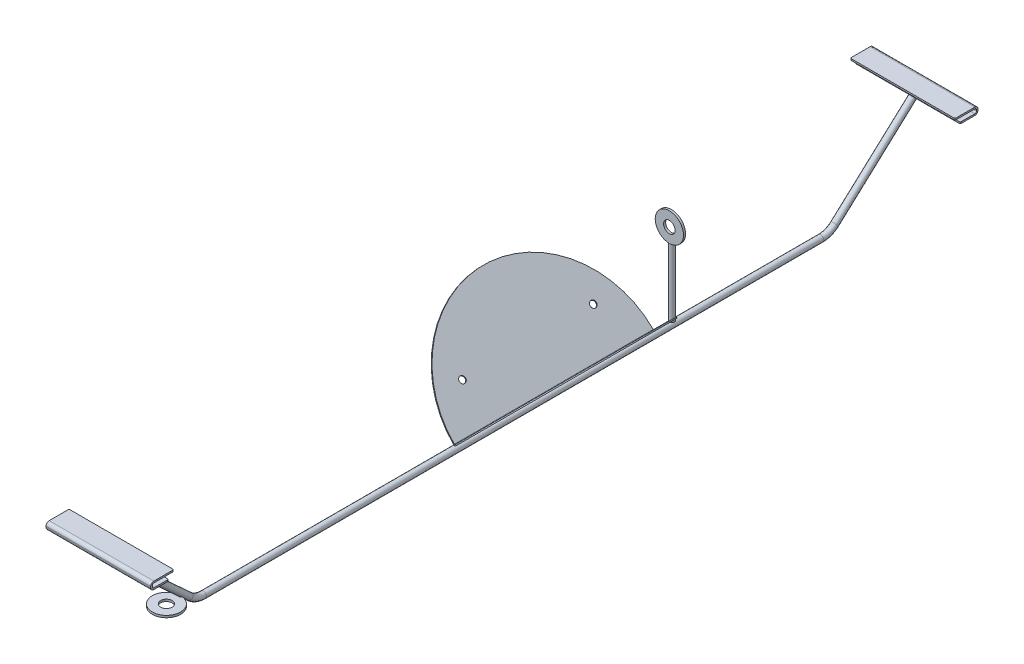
ISO-10303-21;
HEADER;
FILE_DESCRIPTION(('STEP AP214'),'2;1');
FILE_NAME('part.step','',(''),(''),'','','');
FILE_SCHEMA(('AUTOMOTIVE_DESIGN { 1 0 10303 214 1 1 1 1 }'));
ENDSEC;
DATA;
#1=APPLICATION_CONTEXT('core data for automotive mechanical design processes');
#2=APPLICATION_PROTOCOL_DEFINITION('international standard','automotive_design',2000,#1);
#3=PRODUCT_CONTEXT('',#1,'mechanical');
#4=PRODUCT('Part','Part','',(#3));
#5=PRODUCT_RELATED_PRODUCT_CATEGORY('part','',(#4));
#6=PRODUCT_DEFINITION_FORMATION('','',#4);
#7=PRODUCT_DEFINITION_CONTEXT('part definition',#1,'design');
#8=PRODUCT_DEFINITION('design','',#6,#7);
#9=PRODUCT_DEFINITION_SHAPE('','',#8);
#10=(LENGTH_UNIT() NAMED_UNIT(*) SI_UNIT(.MILLI.,.METRE.));
#11=(NAMED_UNIT(*) PLANE_ANGLE_UNIT() SI_UNIT($,.RADIAN.));
#12=(NAMED_UNIT(*) SI_UNIT($,.STERADIAN.) SOLID_ANGLE_UNIT());
#13=UNCERTAINTY_MEASURE_WITH_UNIT(LENGTH_MEASURE(1.E-05),#10,'distance_accuracy_value','');
#14=(GEOMETRIC_REPRESENTATION_CONTEXT(3) GLOBAL_UNCERTAINTY_ASSIGNED_CONTEXT((#13)) GLOBAL_UNIT_ASSIGNED_CONTEXT((#10,
#11,#12)) REPRESENTATION_CONTEXT('',''));
#15=CARTESIAN_POINT('',(0.,0.,0.));
#16=DIRECTION('',(0.,0.,1.));
#17=DIRECTION('',(1.,0.,0.));
#18=AXIS2_PLACEMENT_3D('',#15,#16,#17);
#19=CARTESIAN_POINT('',(50.,79.3140864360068,392.024307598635));
#20=DIRECTION('',(0.,-1.,0.));
#21=DIRECTION('',(0.,0.,1.));
#22=AXIS2_PLACEMENT_3D('',#19,#20,#21);
#23=PLANE('',#22);
#24=DIRECTION('',(0.,0.,1.));
#25=VECTOR('',#24,1.);
#26=CARTESIAN_POINT('',(-5.,79.3140864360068,383.969773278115));
#27=LINE('',#26,#25);
#28=CARTESIAN_POINT('',(-5.,79.3140864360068,383.969773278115));
#29=VERTEX_POINT('',#28);
#30=CARTESIAN_POINT('',(-5.,79.3140864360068,387.969773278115));
#31=VERTEX_POINT('',#30);
#32=EDGE_CURVE('E322',#29,#31,#27,.T.);
#33=ORIENTED_EDGE('',*,*,#32,.F.);
#34=CARTESIAN_POINT('',(0.,79.3140864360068,383.969773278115));
#35=DIRECTION('',(0.,1.,0.));
#36=DIRECTION('',(0.,0.,1.));
#37=AXIS2_PLACEMENT_3D('',#34,#35,#36);
#38=CIRCLE('',#37,5.);
#39=CARTESIAN_POINT('',(5.,79.3140864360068,383.969773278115));
#40=VERTEX_POINT('',#39);
#41=EDGE_CURVE('E329',#40,#29,#38,.T.);
#42=ORIENTED_EDGE('',*,*,#41,.F.);
#43=DIRECTION('',(0.,0.,1.));
#44=VECTOR('',#43,1.);
#45=CARTESIAN_POINT('',(5.,79.3140864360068,383.969773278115));
#46=LINE('',#45,#44);
#47=CARTESIAN_POINT('',(5.,79.3140864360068,387.969773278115));
#48=VERTEX_POINT('',#47);
#49=EDGE_CURVE('E307',#40,#48,#46,.T.);
#50=ORIENTED_EDGE('',*,*,#49,.T.);
#51=CARTESIAN_POINT('',(0.,79.3140864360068,387.969773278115));
#52=DIRECTION('',(0.,1.,0.));
#53=DIRECTION('',(0.,0.,1.));
#54=AXIS2_PLACEMENT_3D('',#51,#52,#53);
#55=CIRCLE('',#54,5.);
#56=CARTESIAN_POINT('',(2.92587618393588,79.3140864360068,392.024307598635));
#57=VERTEX_POINT('',#56);
#58=EDGE_CURVE('E162',#57,#48,#55,.T.);
#59=ORIENTED_EDGE('',*,*,#58,.F.);
#60=DIRECTION('',(-1.,0.,0.));
#61=VECTOR('',#60,1.);
#62=CARTESIAN_POINT('',(50.,79.3140864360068,392.024307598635));
#63=LINE('',#62,#61);
#64=CARTESIAN_POINT('',(50.,79.3140864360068,392.024307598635));
#65=VERTEX_POINT('',#64);
#66=EDGE_CURVE('E393',#65,#57,#63,.T.);
#67=ORIENTED_EDGE('',*,*,#66,.F.);
#68=DIRECTION('',(0.,0.,-1.));
#69=VECTOR('',#68,1.);
#70=CARTESIAN_POINT('',(50.,79.3140864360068,392.024307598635));
#71=LINE('',#70,#69);
#72=CARTESIAN_POINT('',(50.,79.3140864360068,379.024307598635));
#73=VERTEX_POINT('',#72);
#74=EDGE_CURVE('E343',#65,#73,#71,.T.);
#75=ORIENTED_EDGE('',*,*,#74,.T.);
#76=CARTESIAN_POINT('',(49.,79.3140864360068,379.024307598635));
#77=DIRECTION('',(0.,1.,0.));
#78=DIRECTION('',(0.,0.,1.));
#79=AXIS2_PLACEMENT_3D('',#76,#77,#78);
#80=CIRCLE('',#79,1.);
#81=CARTESIAN_POINT('',(49.,79.3140864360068,378.024307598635));
#82=VERTEX_POINT('',#81);
#83=EDGE_CURVE('E434',#82,#73,#80,.F.);
#84=ORIENTED_EDGE('',*,*,#83,.F.);
#85=DIRECTION('',(-1.,0.,0.));
#86=VECTOR('',#85,1.);
#87=CARTESIAN_POINT('',(50.,79.3140864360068,378.024307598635));
#88=LINE('',#87,#86);
#89=CARTESIAN_POINT('',(-49.,79.3140864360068,378.024307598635));
#90=VERTEX_POINT('',#89);
#91=EDGE_CURVE('E427',#82,#90,#88,.T.);
#92=ORIENTED_EDGE('',*,*,#91,.T.);
#93=CARTESIAN_POINT('',(-49.,79.3140864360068,379.024307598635));
#94=DIRECTION('',(0.,1.,0.));
#95=DIRECTION('',(0.,0.,1.));
#96=AXIS2_PLACEMENT_3D('',#93,#94,#95);
#97=CIRCLE('',#96,1.);
#98=CARTESIAN_POINT('',(-50.,79.3140864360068,379.024307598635));
#99=VERTEX_POINT('',#98);
#100=EDGE_CURVE('E437',#99,#90,#97,.F.);
#101=ORIENTED_EDGE('',*,*,#100,.F.);
#102=DIRECTION('',(0.,0.,-1.));
#103=VECTOR('',#102,1.);
#104=CARTESIAN_POINT('',(-50.,79.3140864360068,392.024307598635));
#105=LINE('',#104,#103);
#106=CARTESIAN_POINT('',(-50.,79.3140864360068,392.024307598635));
#107=VERTEX_POINT('',#106);
#108=EDGE_CURVE('E331',#107,#99,#105,.T.);
#109=ORIENTED_EDGE('',*,*,#108,.F.);
#110=CARTESIAN_POINT('',(-2.92587618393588,79.3140864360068,392.024307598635));
#111=VERTEX_POINT('',#110);
#112=EDGE_CURVE('E369',#111,#107,#63,.T.);
#113=ORIENTED_EDGE('',*,*,#112,.F.);
#114=EDGE_CURVE('E338',#31,#111,#55,.T.);
#115=ORIENTED_EDGE('',*,*,#114,.F.);
#116=EDGE_LOOP('',(#33,#42,#50,#59,#67,#75,#84,#92,#101,#109,#113,#115));
#117=FACE_BOUND('',#116,.T.);
#118=ADVANCED_FACE('F148',(#117),#23,.F.);
#119=CARTESIAN_POINT('',(50.,77.8140864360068,378.024307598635));
#120=DIRECTION('',(0.,0.,-1.));
#121=DIRECTION('',(1.,0.,0.));
#122=AXIS2_PLACEMENT_3D('',#119,#120,#121);
#123=PLANE('',#122);
#124=ORIENTED_EDGE('',*,*,#91,.F.);
#125=DIRECTION('',(0.,1.,0.));
#126=VECTOR('',#125,1.);
#127=CARTESIAN_POINT('',(49.,79.3140864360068,378.024307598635));
#128=LINE('',#127,#126);
#129=CARTESIAN_POINT('',(49.,77.8140864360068,378.024307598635));
#130=VERTEX_POINT('',#129);
#131=EDGE_CURVE('E440',#130,#82,#128,.T.);
#132=ORIENTED_EDGE('',*,*,#131,.F.);
#133=DIRECTION('',(-1.,0.,0.));
#134=VECTOR('',#133,1.);
#135=CARTESIAN_POINT('',(50.,77.8140864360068,378.024307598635));
#136=LINE('',#135,#134);
#137=CARTESIAN_POINT('',(-49.,77.8140864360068,378.024307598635));
#138=VERTEX_POINT('',#137);
#139=EDGE_CURVE('E424',#130,#138,#136,.T.);
#140=ORIENTED_EDGE('',*,*,#139,.T.);
#141=DIRECTION('',(0.,1.,0.));
#142=VECTOR('',#141,1.);
#143=CARTESIAN_POINT('',(-49.,77.8140864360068,378.024307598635));
#144=LINE('',#143,#142);
#145=EDGE_CURVE('E442',#90,#138,#144,.F.);
#146=ORIENTED_EDGE('',*,*,#145,.F.);
#147=EDGE_LOOP('',(#124,#132,#140,#146));
#148=FACE_BOUND('',#147,.T.);
#149=ADVANCED_FACE('F510',(#148),#123,.T.);
#150=CARTESIAN_POINT('',(50.,77.8140864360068,392.024307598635));
#151=DIRECTION('',(0.,-1.,0.));
#152=DIRECTION('',(0.,0.,1.));
#153=AXIS2_PLACEMENT_3D('',#150,#151,#152);
#154=PLANE('',#153);
#155=CARTESIAN_POINT('',(0.,77.8140864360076,387.969773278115));
#156=DIRECTION('',(0.,1.,0.));
#157=DIRECTION('',(0.,0.,1.));
#158=AXIS2_PLACEMENT_3D('',#155,#156,#157);
#159=CIRCLE('',#158,5.);
#160=CARTESIAN_POINT('',(-5.00000000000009,77.8140864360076,387.969773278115));
#161=VERTEX_POINT('',#160);
#162=CARTESIAN_POINT('',(-2.92587618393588,77.8140864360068,392.024307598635));
#163=VERTEX_POINT('',#162);
#164=EDGE_CURVE('E335',#161,#163,#159,.T.);
#165=ORIENTED_EDGE('',*,*,#164,.T.);
#166=DIRECTION('',(-1.,0.,0.));
#167=VECTOR('',#166,1.);
#168=CARTESIAN_POINT('',(50.,77.8140864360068,392.024307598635));
#169=LINE('',#168,#167);
#170=CARTESIAN_POINT('',(-50.,77.8140864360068,392.024307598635));
#171=VERTEX_POINT('',#170);
#172=EDGE_CURVE('E421',#163,#171,#169,.T.);
#173=ORIENTED_EDGE('',*,*,#172,.T.);
#174=DIRECTION('',(0.,0.,-1.));
#175=VECTOR('',#174,1.);
#176=CARTESIAN_POINT('',(-50.,77.8140864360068,392.024307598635));
#177=LINE('',#176,#175);
#178=CARTESIAN_POINT('',(-50.,77.8140864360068,379.024307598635));
#179=VERTEX_POINT('',#178);
#180=EDGE_CURVE('E372',#171,#179,#177,.T.);
#181=ORIENTED_EDGE('',*,*,#180,.T.);
#182=CARTESIAN_POINT('',(-49.,77.8140864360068,379.024307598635));
#183=DIRECTION('',(0.,1.,0.));
#184=DIRECTION('',(0.,0.,1.));
#185=AXIS2_PLACEMENT_3D('',#182,#183,#184);
#186=CIRCLE('',#185,1.);
#187=EDGE_CURVE('E447',#138,#179,#186,.T.);
#188=ORIENTED_EDGE('',*,*,#187,.F.);
#189=ORIENTED_EDGE('',*,*,#139,.F.);
#190=CARTESIAN_POINT('',(49.,77.8140864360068,379.024307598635));
#191=DIRECTION('',(0.,1.,0.));
#192=DIRECTION('',(0.,0.,1.));
#193=AXIS2_PLACEMENT_3D('',#190,#191,#192);
#194=CIRCLE('',#193,1.);
#195=CARTESIAN_POINT('',(50.,77.8140864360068,379.024307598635));
#196=VERTEX_POINT('',#195);
#197=EDGE_CURVE('E445',#196,#130,#194,.T.);
#198=ORIENTED_EDGE('',*,*,#197,.F.);
#199=DIRECTION('',(0.,0.,-1.));
#200=VECTOR('',#199,1.);
#201=CARTESIAN_POINT('',(50.,77.8140864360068,392.024307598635));
#202=LINE('',#201,#200);
#203=CARTESIAN_POINT('',(50.,77.8140864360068,392.024307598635));
#204=VERTEX_POINT('',#203);
#205=EDGE_CURVE('E346',#204,#196,#202,.T.);
#206=ORIENTED_EDGE('',*,*,#205,.F.);
#207=CARTESIAN_POINT('',(2.92587618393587,77.8140864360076,392.024307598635));
#208=VERTEX_POINT('',#207);
#209=EDGE_CURVE('E422',#204,#208,#169,.T.);
#210=ORIENTED_EDGE('',*,*,#209,.T.);
#211=CARTESIAN_POINT('',(5.,77.8140864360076,387.969773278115));
#212=VERTEX_POINT('',#211);
#213=EDGE_CURVE('E321',#208,#212,#159,.T.);
#214=ORIENTED_EDGE('',*,*,#213,.T.);
#215=DIRECTION('',(0.,0.,1.));
#216=VECTOR('',#215,1.);
#217=CARTESIAN_POINT('',(5.,77.8140864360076,383.969773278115));
#218=LINE('',#217,#216);
#219=CARTESIAN_POINT('',(5.,77.8140864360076,383.969773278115));
#220=VERTEX_POINT('',#219);
#221=EDGE_CURVE('E304',#220,#212,#218,.T.);
#222=ORIENTED_EDGE('',*,*,#221,.F.);
#223=CARTESIAN_POINT('',(0.,77.8140864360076,383.969773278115));
#224=DIRECTION('',(0.,1.,0.));
#225=DIRECTION('',(0.,0.,1.));
#226=AXIS2_PLACEMENT_3D('',#223,#224,#225);
#227=CIRCLE('',#226,5.);
#228=CARTESIAN_POINT('',(-5.,77.8140864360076,383.969773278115));
#229=VERTEX_POINT('',#228);
#230=EDGE_CURVE('E309',#220,#229,#227,.T.);
#231=ORIENTED_EDGE('',*,*,#230,.T.);
#232=DIRECTION('',(0.,0.,1.));
#233=VECTOR('',#232,1.);
#234=CARTESIAN_POINT('',(-5.00000000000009,77.8140864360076,383.969773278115));
#235=LINE('',#234,#233);
#236=EDGE_CURVE('E325',#229,#161,#235,.T.);
#237=ORIENTED_EDGE('',*,*,#236,.T.);
#238=EDGE_LOOP('',(#165,#173,#181,#188,#189,#198,#206,#210,#214,#222,#231,#237));
#239=FACE_BOUND('',#238,.T.);
#240=ADVANCED_FACE('F319',(#239),#154,.T.);
#241=CARTESIAN_POINT('',(50.,80.8140864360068,392.024307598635));
#242=DIRECTION('',(-1.,0.,0.));
#243=DIRECTION('',(0.,0.,-1.));
#244=AXIS2_PLACEMENT_3D('',#241,#242,#243);
#245=CYLINDRICAL_SURFACE('',#244,3.);
#246=CARTESIAN_POINT('',(-2.92587618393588,77.8140864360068,392.024307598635));
#247=CARTESIAN_POINT('',(-2.8227827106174,77.8141095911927,392.098717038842));
#248=CARTESIAN_POINT('',(-2.71688772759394,77.8168542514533,392.16914056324));
#249=CARTESIAN_POINT('',(-2.50023553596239,77.8261876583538,392.301620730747));
#250=CARTESIAN_POINT('',(-2.38948158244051,77.8327738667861,392.363682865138));
#251=CARTESIAN_POINT('',(-2.16351068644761,77.8482096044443,392.479248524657));
#252=CARTESIAN_POINT('',(-2.04828605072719,77.8570631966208,392.532736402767));
#253=CARTESIAN_POINT('',(-1.81413829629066,77.87560390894,392.630783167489));
#254=CARTESIAN_POINT('',(-1.69521439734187,77.8852912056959,392.67534015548));
#255=CARTESIAN_POINT('',(-1.44580536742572,77.9048802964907,392.758103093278));
#256=CARTESIAN_POINT('',(-1.31509550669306,77.9147492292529,392.795641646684));
#257=CARTESIAN_POINT('',(-1.05093231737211,77.9326309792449,392.859969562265));
#258=CARTESIAN_POINT('',(-0.917479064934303,77.9406438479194,392.886759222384));
#259=CARTESIAN_POINT('',(-0.648896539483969,77.9537720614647,392.929348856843));
#260=CARTESIAN_POINT('',(-0.513770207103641,77.9588919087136,392.945165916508));
#261=CARTESIAN_POINT('',(-0.242590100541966,77.9656076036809,392.965735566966));
#262=CARTESIAN_POINT('',(-0.106536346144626,77.967203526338,392.970488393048));
#263=CARTESIAN_POINT('',(0.166481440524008,77.9666688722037,392.968878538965));
#264=CARTESIAN_POINT('',(0.303444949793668,77.9645112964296,392.962435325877));
#265=CARTESIAN_POINT('',(0.576282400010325,77.9566919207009,392.938340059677));
#266=CARTESIAN_POINT('',(0.712156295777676,77.9510299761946,392.920687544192));
#267=CARTESIAN_POINT('',(0.982056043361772,77.9369167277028,392.87429632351));
#268=CARTESIAN_POINT('',(1.11607877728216,77.9284612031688,392.84554083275));
#269=CARTESIAN_POINT('',(1.38120138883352,77.909872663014,392.777165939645));
#270=CARTESIAN_POINT('',(1.51230129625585,77.8997396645,392.737546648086));
#271=CARTESIAN_POINT('',(1.75588587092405,77.8803940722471,392.652883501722));
#272=CARTESIAN_POINT('',(1.86877478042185,77.8712099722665,392.608990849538));
#273=CARTESIAN_POINT('',(2.09110838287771,77.853775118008,392.513111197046));
#274=CARTESIAN_POINT('',(2.20055390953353,77.8455241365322,392.461126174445));
#275=CARTESIAN_POINT('',(2.41528551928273,77.8312192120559,392.349385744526));
#276=CARTESIAN_POINT('',(2.52057956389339,77.8251608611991,392.289646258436));
#277=CARTESIAN_POINT('',(2.72672626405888,77.8166028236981,392.162583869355));
#278=CARTESIAN_POINT('',(2.82757595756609,77.8141054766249,392.095256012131));
#279=CARTESIAN_POINT('',(2.92587618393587,77.8140864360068,392.024307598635));
#280=B_SPLINE_CURVE_WITH_KNOTS('',3,(#246,#247,#248,#249,#250,#251,#252,#253,#254,#255,#256,
#257,#258,#259,#260,#261,#262,#263,#264,#265,#266,#267,#268,#269,#270,#271,#272,#273,#274,#275,
#276,#277,#278,#279),.UNSPECIFIED.,.F.,.F.,(4,2,2,2,2,2,2,2,2,2,2,2,2,2,2,2,4),(0.,
0.381218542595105,0.762185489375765,1.1438399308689,1.5255754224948,1.93416851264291,
2.3427502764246,2.75069440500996,3.15862985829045,3.5695117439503,3.98041057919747,
4.39193306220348,4.80345134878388,5.16754848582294,5.53155677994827,5.89482918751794,
6.25834015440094),.UNSPECIFIED.);
#281=EDGE_CURVE('E15',#163,#208,#280,.T.);
#282=ORIENTED_EDGE('',*,*,#281,.T.);
#283=ORIENTED_EDGE('',*,*,#209,.F.);
#284=CARTESIAN_POINT('',(50.,80.8140864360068,392.024307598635));
#285=DIRECTION('',(1.,0.,0.));
#286=DIRECTION('',(0.,0.,-1.));
#287=AXIS2_PLACEMENT_3D('',#284,#285,#286);
#288=CIRCLE('',#287,3.);
#289=CARTESIAN_POINT('',(50.,80.8140864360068,395.024307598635));
#290=VERTEX_POINT('',#289);
#291=EDGE_CURVE('E350',#290,#204,#288,.T.);
#292=ORIENTED_EDGE('',*,*,#291,.F.);
#293=DIRECTION('',(-1.,0.,0.));
#294=VECTOR('',#293,1.);
#295=CARTESIAN_POINT('',(50.,80.8140864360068,395.024307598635));
#296=LINE('',#295,#294);
#297=CARTESIAN_POINT('',(-50.,80.8140864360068,395.024307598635));
#298=VERTEX_POINT('',#297);
#299=EDGE_CURVE('E418',#290,#298,#296,.T.);
#300=ORIENTED_EDGE('',*,*,#299,.T.);
#301=CARTESIAN_POINT('',(-50.,80.8140864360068,392.024307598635));
#302=DIRECTION('',(1.,0.,0.));
#303=DIRECTION('',(0.,0.,-1.));
#304=AXIS2_PLACEMENT_3D('',#301,#302,#303);
#305=CIRCLE('',#304,3.);
#306=EDGE_CURVE('E375',#298,#171,#305,.T.);
#307=ORIENTED_EDGE('',*,*,#306,.T.);
#308=ORIENTED_EDGE('',*,*,#172,.F.);
#309=EDGE_LOOP('',(#282,#283,#292,#300,#307,#308));
#310=FACE_BOUND('',#309,.T.);
#311=ADVANCED_FACE('F492',(#310),#245,.T.);
#312=CARTESIAN_POINT('',(50.,81.8140864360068,395.024307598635));
#313=DIRECTION('',(0.,0.,1.));
#314=DIRECTION('',(-1.,0.,0.));
#315=AXIS2_PLACEMENT_3D('',#312,#313,#314);
#316=PLANE('',#315);
#317=DIRECTION('',(0.,-1.,0.));
#318=VECTOR('',#317,1.);
#319=CARTESIAN_POINT('',(-50.,81.8140864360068,395.024307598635));
#320=LINE('',#319,#318);
#321=CARTESIAN_POINT('',(-50.,81.8140864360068,395.024307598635));
#322=VERTEX_POINT('',#321);
#323=EDGE_CURVE('E377',#322,#298,#320,.T.);
#324=ORIENTED_EDGE('',*,*,#323,.T.);
#325=ORIENTED_EDGE('',*,*,#299,.F.);
#326=DIRECTION('',(0.,-1.,0.));
#327=VECTOR('',#326,1.);
#328=CARTESIAN_POINT('',(50.,81.8140864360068,395.024307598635));
#329=LINE('',#328,#327);
#330=CARTESIAN_POINT('',(50.,81.8140864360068,395.024307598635));
#331=VERTEX_POINT('',#330);
#332=EDGE_CURVE('E352',#331,#290,#329,.T.);
#333=ORIENTED_EDGE('',*,*,#332,.F.);
#334=DIRECTION('',(-1.,0.,0.));
#335=VECTOR('',#334,1.);
#336=CARTESIAN_POINT('',(50.,81.8140864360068,395.024307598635));
#337=LINE('',#336,#335);
#338=EDGE_CURVE('E415',#331,#322,#337,.T.);
#339=ORIENTED_EDGE('',*,*,#338,.T.);
#340=EDGE_LOOP('',(#324,#325,#333,#339));
#341=FACE_BOUND('',#340,.T.);
#342=ADVANCED_FACE('F519',(#341),#316,.T.);
#343=CARTESIAN_POINT('',(50.,81.8140864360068,392.024307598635));
#344=DIRECTION('',(-1.,0.,0.));
#345=DIRECTION('',(0.,0.,-1.));
#346=AXIS2_PLACEMENT_3D('',#343,#344,#345);
#347=CYLINDRICAL_SURFACE('',#346,3.);
#348=CARTESIAN_POINT('',(-50.,81.8140864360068,392.024307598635));
#349=DIRECTION('',(1.,0.,0.));
#350=DIRECTION('',(0.,0.,-1.));
#351=AXIS2_PLACEMENT_3D('',#348,#349,#350);
#352=CIRCLE('',#351,3.);
#353=CARTESIAN_POINT('',(-50.,84.8140864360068,392.024307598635));
#354=VERTEX_POINT('',#353);
#355=EDGE_CURVE('E379',#354,#322,#352,.T.);
#356=ORIENTED_EDGE('',*,*,#355,.T.);
#357=ORIENTED_EDGE('',*,*,#338,.F.);
#358=CARTESIAN_POINT('',(50.,81.8140864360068,392.024307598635));
#359=DIRECTION('',(1.,0.,0.));
#360=DIRECTION('',(0.,0.,-1.));
#361=AXIS2_PLACEMENT_3D('',#358,#359,#360);
#362=CIRCLE('',#361,3.);
#363=CARTESIAN_POINT('',(50.,84.8140864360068,392.024307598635));
#364=VERTEX_POINT('',#363);
#365=EDGE_CURVE('E354',#364,#331,#362,.T.);
#366=ORIENTED_EDGE('',*,*,#365,.F.);
#367=DIRECTION('',(-1.,0.,0.));
#368=VECTOR('',#367,1.);
#369=CARTESIAN_POINT('',(50.,84.8140864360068,392.024307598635));
#370=LINE('',#369,#368);
#371=EDGE_CURVE('E412',#364,#354,#370,.T.);
#372=ORIENTED_EDGE('',*,*,#371,.T.);
#373=EDGE_LOOP('',(#356,#357,#366,#372));
#374=FACE_BOUND('',#373,.T.);
#375=ADVANCED_FACE('F523',(#374),#347,.T.);
#376=CARTESIAN_POINT('',(50.,84.8140864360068,373.024307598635));
#377=DIRECTION('',(0.,1.,0.));
#378=DIRECTION('',(0.,0.,-1.));
#379=AXIS2_PLACEMENT_3D('',#376,#377,#378);
#380=PLANE('',#379);
#381=DIRECTION('',(0.,0.,1.));
#382=VECTOR('',#381,1.);
#383=CARTESIAN_POINT('',(-50.,84.8140864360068,373.024307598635));
#384=LINE('',#383,#382);
#385=CARTESIAN_POINT('',(-50.,84.8140864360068,374.024307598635));
#386=VERTEX_POINT('',#385);
#387=EDGE_CURVE('E381',#386,#354,#384,.T.);
#388=ORIENTED_EDGE('',*,*,#387,.T.);
#389=ORIENTED_EDGE('',*,*,#371,.F.);
#390=DIRECTION('',(0.,0.,1.));
#391=VECTOR('',#390,1.);
#392=CARTESIAN_POINT('',(50.,84.8140864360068,373.024307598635));
#393=LINE('',#392,#391);
#394=CARTESIAN_POINT('',(50.,84.8140864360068,374.024307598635));
#395=VERTEX_POINT('',#394);
#396=EDGE_CURVE('E356',#395,#364,#393,.T.);
#397=ORIENTED_EDGE('',*,*,#396,.F.);
#398=CARTESIAN_POINT('',(49.,84.8140864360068,374.024307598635));
#399=DIRECTION('',(0.,-1.,0.));
#400=DIRECTION('',(0.,0.,-1.));
#401=AXIS2_PLACEMENT_3D('',#398,#399,#400);
#402=CIRCLE('',#401,1.);
#403=CARTESIAN_POINT('',(49.,84.8140864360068,373.024307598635));
#404=VERTEX_POINT('',#403);
#405=EDGE_CURVE('E450',#404,#395,#402,.T.);
#406=ORIENTED_EDGE('',*,*,#405,.F.);
#407=DIRECTION('',(-1.,0.,0.));
#408=VECTOR('',#407,1.);
#409=CARTESIAN_POINT('',(50.,84.8140864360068,373.024307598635));
#410=LINE('',#409,#408);
#411=CARTESIAN_POINT('',(-49.,84.8140864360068,373.024307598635));
#412=VERTEX_POINT('',#411);
#413=EDGE_CURVE('E409',#404,#412,#410,.T.);
#414=ORIENTED_EDGE('',*,*,#413,.T.);
#415=CARTESIAN_POINT('',(-49.,84.8140864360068,374.024307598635));
#416=DIRECTION('',(0.,-1.,0.));
#417=DIRECTION('',(0.,0.,-1.));
#418=AXIS2_PLACEMENT_3D('',#415,#416,#417);
#419=CIRCLE('',#418,1.);
#420=EDGE_CURVE('E453',#386,#412,#419,.T.);
#421=ORIENTED_EDGE('',*,*,#420,.F.);
#422=EDGE_LOOP('',(#388,#389,#397,#406,#414,#421));
#423=FACE_BOUND('',#422,.T.);
#424=ADVANCED_FACE('F527',(#423),#380,.T.);
#425=CARTESIAN_POINT('',(50.,83.3140864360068,373.024307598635));
#426=DIRECTION('',(0.,0.,-1.));
#427=DIRECTION('',(1.,0.,0.));
#428=AXIS2_PLACEMENT_3D('',#425,#426,#427);
#429=PLANE('',#428);
#430=ORIENTED_EDGE('',*,*,#413,.F.);
#431=DIRECTION('',(0.,1.,0.));
#432=VECTOR('',#431,1.);
#433=CARTESIAN_POINT('',(49.,84.8140864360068,373.024307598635));
#434=LINE('',#433,#432);
#435=CARTESIAN_POINT('',(49.,83.3140864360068,373.024307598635));
#436=VERTEX_POINT('',#435);
#437=EDGE_CURVE('E456',#436,#404,#434,.T.);
#438=ORIENTED_EDGE('',*,*,#437,.F.);
#439=DIRECTION('',(-1.,0.,0.));
#440=VECTOR('',#439,1.);
#441=CARTESIAN_POINT('',(50.,83.3140864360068,373.024307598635));
#442=LINE('',#441,#440);
#443=CARTESIAN_POINT('',(-49.,83.3140864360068,373.024307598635));
#444=VERTEX_POINT('',#443);
#445=EDGE_CURVE('E406',#436,#444,#442,.T.);
#446=ORIENTED_EDGE('',*,*,#445,.T.);
#447=DIRECTION('',(0.,1.,0.));
#448=VECTOR('',#447,1.);
#449=CARTESIAN_POINT('',(-49.,83.3140864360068,373.024307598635));
#450=LINE('',#449,#448);
#451=EDGE_CURVE('E458',#412,#444,#450,.F.);
#452=ORIENTED_EDGE('',*,*,#451,.F.);
#453=EDGE_LOOP('',(#430,#438,#446,#452));
#454=FACE_BOUND('',#453,.T.);
#455=ADVANCED_FACE('F548',(#454),#429,.T.);
#456=CARTESIAN_POINT('',(50.,83.3140864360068,373.024307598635));
#457=DIRECTION('',(0.,1.,0.));
#458=DIRECTION('',(0.,0.,-1.));
#459=AXIS2_PLACEMENT_3D('',#456,#457,#458);
#460=PLANE('',#459);
#461=ORIENTED_EDGE('',*,*,#445,.F.);
#462=CARTESIAN_POINT('',(49.,83.3140864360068,374.024307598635));
#463=DIRECTION('',(0.,-1.,0.));
#464=DIRECTION('',(0.,0.,-1.));
#465=AXIS2_PLACEMENT_3D('',#462,#463,#464);
#466=CIRCLE('',#465,1.);
#467=CARTESIAN_POINT('',(50.,83.3140864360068,374.024307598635));
#468=VERTEX_POINT('',#467);
#469=EDGE_CURVE('E461',#468,#436,#466,.F.);
#470=ORIENTED_EDGE('',*,*,#469,.F.);
#471=DIRECTION('',(0.,0.,1.));
#472=VECTOR('',#471,1.);
#473=CARTESIAN_POINT('',(50.,83.3140864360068,373.024307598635));
#474=LINE('',#473,#472);
#475=CARTESIAN_POINT('',(50.,83.3140864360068,392.024307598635));
#476=VERTEX_POINT('',#475);
#477=EDGE_CURVE('E358',#468,#476,#474,.T.);
#478=ORIENTED_EDGE('',*,*,#477,.T.);
#479=DIRECTION('',(-1.,0.,0.));
#480=VECTOR('',#479,1.);
#481=CARTESIAN_POINT('',(50.,83.3140864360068,392.024307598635));
#482=LINE('',#481,#480);
#483=CARTESIAN_POINT('',(-50.,83.3140864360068,392.024307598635));
#484=VERTEX_POINT('',#483);
#485=EDGE_CURVE('E403',#476,#484,#482,.T.);
#486=ORIENTED_EDGE('',*,*,#485,.T.);
#487=DIRECTION('',(0.,0.,1.));
#488=VECTOR('',#487,1.);
#489=CARTESIAN_POINT('',(-50.,83.3140864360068,373.024307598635));
#490=LINE('',#489,#488);
#491=CARTESIAN_POINT('',(-50.,83.3140864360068,374.024307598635));
#492=VERTEX_POINT('',#491);
#493=EDGE_CURVE('E383',#492,#484,#490,.T.);
#494=ORIENTED_EDGE('',*,*,#493,.F.);
#495=CARTESIAN_POINT('',(-49.,83.3140864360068,374.024307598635));
#496=DIRECTION('',(0.,-1.,0.));
#497=DIRECTION('',(0.,0.,-1.));
#498=AXIS2_PLACEMENT_3D('',#495,#496,#497);
#499=CIRCLE('',#498,1.);
#500=EDGE_CURVE('E463',#444,#492,#499,.F.);
#501=ORIENTED_EDGE('',*,*,#500,.F.);
#502=EDGE_LOOP('',(#461,#470,#478,#486,#494,#501));
#503=FACE_BOUND('',#502,.T.);
#504=ADVANCED_FACE('F537',(#503),#460,.F.);
#505=CARTESIAN_POINT('',(50.,81.8140864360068,392.024307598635));
#506=DIRECTION('',(-1.,0.,0.));
#507=DIRECTION('',(0.,0.,-1.));
#508=AXIS2_PLACEMENT_3D('',#505,#506,#507);
#509=CYLINDRICAL_SURFACE('',#508,1.5);
#510=CARTESIAN_POINT('',(-50.,81.8140864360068,392.024307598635));
#511=DIRECTION('',(-1.,0.,0.));
#512=DIRECTION('',(0.,0.,1.));
#513=AXIS2_PLACEMENT_3D('',#510,#511,#512);
#514=CIRCLE('',#513,1.5);
#515=CARTESIAN_POINT('',(-50.,81.8140864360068,393.524307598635));
#516=VERTEX_POINT('',#515);
#517=EDGE_CURVE('E386',#484,#516,#514,.F.);
#518=ORIENTED_EDGE('',*,*,#517,.F.);
#519=ORIENTED_EDGE('',*,*,#485,.F.);
#520=CARTESIAN_POINT('',(50.,81.8140864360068,392.024307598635));
#521=DIRECTION('',(-1.,0.,0.));
#522=DIRECTION('',(0.,0.,1.));
#523=AXIS2_PLACEMENT_3D('',#520,#521,#522);
#524=CIRCLE('',#523,1.5);
#525=CARTESIAN_POINT('',(50.,81.8140864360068,393.524307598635));
#526=VERTEX_POINT('',#525);
#527=EDGE_CURVE('E361',#476,#526,#524,.F.);
#528=ORIENTED_EDGE('',*,*,#527,.T.);
#529=DIRECTION('',(-1.,0.,0.));
#530=VECTOR('',#529,1.);
#531=CARTESIAN_POINT('',(50.,81.8140864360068,393.524307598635));
#532=LINE('',#531,#530);
#533=EDGE_CURVE('E400',#526,#516,#532,.T.);
#534=ORIENTED_EDGE('',*,*,#533,.T.);
#535=EDGE_LOOP('',(#518,#519,#528,#534));
#536=FACE_BOUND('',#535,.T.);
#537=ADVANCED_FACE('F541',(#536),#509,.F.);
#538=CARTESIAN_POINT('',(50.,81.8140864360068,393.524307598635));
#539=DIRECTION('',(0.,0.,1.));
#540=DIRECTION('',(-1.,0.,0.));
#541=AXIS2_PLACEMENT_3D('',#538,#539,#540);
#542=PLANE('',#541);
#543=DIRECTION('',(0.,1.,0.));
#544=VECTOR('',#543,1.);
#545=CARTESIAN_POINT('',(-50.,81.8140864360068,393.524307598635));
#546=LINE('',#545,#544);
#547=CARTESIAN_POINT('',(-50.,80.8140864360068,393.524307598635));
#548=VERTEX_POINT('',#547);
#549=EDGE_CURVE('E389',#516,#548,#546,.F.);
#550=ORIENTED_EDGE('',*,*,#549,.F.);
#551=ORIENTED_EDGE('',*,*,#533,.F.);
#552=DIRECTION('',(0.,1.,0.));
#553=VECTOR('',#552,1.);
#554=CARTESIAN_POINT('',(50.,81.8140864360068,393.524307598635));
#555=LINE('',#554,#553);
#556=CARTESIAN_POINT('',(50.,80.8140864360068,393.524307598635));
#557=VERTEX_POINT('',#556);
#558=EDGE_CURVE('E364',#526,#557,#555,.F.);
#559=ORIENTED_EDGE('',*,*,#558,.T.);
#560=DIRECTION('',(-1.,0.,0.));
#561=VECTOR('',#560,1.);
#562=CARTESIAN_POINT('',(50.,80.8140864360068,393.524307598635));
#563=LINE('',#562,#561);
#564=EDGE_CURVE('E396',#557,#548,#563,.T.);
#565=ORIENTED_EDGE('',*,*,#564,.T.);
#566=EDGE_LOOP('',(#550,#551,#559,#565));
#567=FACE_BOUND('',#566,.T.);
#568=ADVANCED_FACE('F544',(#567),#542,.F.);
#569=CARTESIAN_POINT('',(50.,80.8140864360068,392.024307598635));
#570=DIRECTION('',(-1.,0.,0.));
#571=DIRECTION('',(0.,0.,-1.));
#572=AXIS2_PLACEMENT_3D('',#569,#570,#571);
#573=CYLINDRICAL_SURFACE('',#572,1.5);
#574=CARTESIAN_POINT('',(-50.,80.8140864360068,392.024307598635));
#575=DIRECTION('',(-1.,0.,0.));
#576=DIRECTION('',(0.,0.,1.));
#577=AXIS2_PLACEMENT_3D('',#574,#575,#576);
#578=CIRCLE('',#577,1.5);
#579=EDGE_CURVE('E347',#548,#107,#578,.F.);
#580=ORIENTED_EDGE('',*,*,#579,.F.);
#581=ORIENTED_EDGE('',*,*,#564,.F.);
#582=CARTESIAN_POINT('',(50.,80.8140864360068,392.024307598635));
#583=DIRECTION('',(-1.,0.,0.));
#584=DIRECTION('',(0.,0.,1.));
#585=AXIS2_PLACEMENT_3D('',#582,#583,#584);
#586=CIRCLE('',#585,1.5);
#587=EDGE_CURVE('E367',#557,#65,#586,.F.);
#588=ORIENTED_EDGE('',*,*,#587,.T.);
#589=ORIENTED_EDGE('',*,*,#66,.T.);
#590=EDGE_CURVE('E397',#57,#111,#63,.T.);
#591=ORIENTED_EDGE('',*,*,#590,.T.);
#592=ORIENTED_EDGE('',*,*,#112,.T.);
#593=EDGE_LOOP('',(#580,#581,#588,#589,#591,#592));
#594=FACE_BOUND('',#593,.T.);
#595=ADVANCED_FACE('F481',(#594),#573,.F.);
#596=CARTESIAN_POINT('',(50.,80.8140864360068,392.024307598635));
#597=DIRECTION('',(-1.,0.,0.));
#598=DIRECTION('',(0.,0.,-1.));
#599=AXIS2_PLACEMENT_3D('',#596,#597,#598);
#600=PLANE('',#599);
#601=ORIENTED_EDGE('',*,*,#74,.F.);
#602=ORIENTED_EDGE('',*,*,#587,.F.);
#603=ORIENTED_EDGE('',*,*,#558,.F.);
#604=ORIENTED_EDGE('',*,*,#527,.F.);
#605=ORIENTED_EDGE('',*,*,#477,.F.);
#606=DIRECTION('',(0.,1.,0.));
#607=VECTOR('',#606,1.);
#608=CARTESIAN_POINT('',(50.,83.3140864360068,374.024307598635));
#609=LINE('',#608,#607);
#610=EDGE_CURVE('E466',#395,#468,#609,.F.);
#611=ORIENTED_EDGE('',*,*,#610,.F.);
#612=ORIENTED_EDGE('',*,*,#396,.T.);
#613=ORIENTED_EDGE('',*,*,#365,.T.);
#614=ORIENTED_EDGE('',*,*,#332,.T.);
#615=ORIENTED_EDGE('',*,*,#291,.T.);
#616=ORIENTED_EDGE('',*,*,#205,.T.);
#617=DIRECTION('',(0.,1.,0.));
#618=VECTOR('',#617,1.);
#619=CARTESIAN_POINT('',(50.,77.8140864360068,379.024307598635));
#620=LINE('',#619,#618);
#621=EDGE_CURVE('E467',#73,#196,#620,.F.);
#622=ORIENTED_EDGE('',*,*,#621,.F.);
#623=EDGE_LOOP('',(#601,#602,#603,#604,#605,#611,#612,#613,#614,#615,#616,#622));
#624=FACE_BOUND('',#623,.T.);
#625=ADVANCED_FACE('F514',(#624),#600,.F.);
#626=CARTESIAN_POINT('',(-50.,80.8140864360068,392.024307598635));
#627=DIRECTION('',(-1.,0.,0.));
#628=DIRECTION('',(0.,0.,-1.));
#629=AXIS2_PLACEMENT_3D('',#626,#627,#628);
#630=PLANE('',#629);
#631=ORIENTED_EDGE('',*,*,#180,.F.);
#632=ORIENTED_EDGE('',*,*,#306,.F.);
#633=ORIENTED_EDGE('',*,*,#323,.F.);
#634=ORIENTED_EDGE('',*,*,#355,.F.);
#635=ORIENTED_EDGE('',*,*,#387,.F.);
#636=DIRECTION('',(0.,1.,0.));
#637=VECTOR('',#636,1.);
#638=CARTESIAN_POINT('',(-50.,80.8140864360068,374.024307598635));
#639=LINE('',#638,#637);
#640=EDGE_CURVE('E430',#492,#386,#639,.T.);
#641=ORIENTED_EDGE('',*,*,#640,.F.);
#642=ORIENTED_EDGE('',*,*,#493,.T.);
#643=ORIENTED_EDGE('',*,*,#517,.T.);
#644=ORIENTED_EDGE('',*,*,#549,.T.);
#645=ORIENTED_EDGE('',*,*,#579,.T.);
#646=ORIENTED_EDGE('',*,*,#108,.T.);
#647=DIRECTION('',(0.,1.,0.));
#648=VECTOR('',#647,1.);
#649=CARTESIAN_POINT('',(-50.,80.8140864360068,379.024307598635));
#650=LINE('',#649,#648);
#651=EDGE_CURVE('E432',#179,#99,#650,.T.);
#652=ORIENTED_EDGE('',*,*,#651,.F.);
#653=EDGE_LOOP('',(#631,#632,#633,#634,#635,#641,#642,#643,#644,#645,#646,#652));
#654=FACE_BOUND('',#653,.T.);
#655=ADVANCED_FACE('F499',(#654),#630,.T.);
#656=CARTESIAN_POINT('',(-49.,80.8140864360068,379.024307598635));
#657=DIRECTION('',(0.,1.,0.));
#658=DIRECTION('',(0.,0.,-1.));
#659=AXIS2_PLACEMENT_3D('',#656,#657,#658);
#660=CYLINDRICAL_SURFACE('',#659,1.);
#661=ORIENTED_EDGE('',*,*,#187,.T.);
#662=ORIENTED_EDGE('',*,*,#651,.T.);
#663=ORIENTED_EDGE('',*,*,#100,.T.);
#664=ORIENTED_EDGE('',*,*,#145,.T.);
#665=EDGE_LOOP('',(#661,#662,#663,#664));
#666=FACE_BOUND('',#665,.T.);
#667=ADVANCED_FACE('F503',(#666),#660,.T.);
#668=CARTESIAN_POINT('',(-49.,80.8140864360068,374.024307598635));
#669=DIRECTION('',(0.,1.,0.));
#670=DIRECTION('',(0.,0.,-1.));
#671=AXIS2_PLACEMENT_3D('',#668,#669,#670);
#672=CYLINDRICAL_SURFACE('',#671,1.);
#673=ORIENTED_EDGE('',*,*,#500,.T.);
#674=ORIENTED_EDGE('',*,*,#640,.T.);
#675=ORIENTED_EDGE('',*,*,#420,.T.);
#676=ORIENTED_EDGE('',*,*,#451,.T.);
#677=EDGE_LOOP('',(#673,#674,#675,#676));
#678=FACE_BOUND('',#677,.T.);
#679=ADVANCED_FACE('F532',(#678),#672,.T.);
#680=CARTESIAN_POINT('',(49.,77.8140864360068,379.024307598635));
#681=DIRECTION('',(0.,-1.,0.));
#682=DIRECTION('',(0.,0.,1.));
#683=AXIS2_PLACEMENT_3D('',#680,#681,#682);
#684=CYLINDRICAL_SURFACE('',#683,1.);
#685=ORIENTED_EDGE('',*,*,#197,.T.);
#686=ORIENTED_EDGE('',*,*,#131,.T.);
#687=ORIENTED_EDGE('',*,*,#83,.T.);
#688=ORIENTED_EDGE('',*,*,#621,.T.);
#689=EDGE_LOOP('',(#685,#686,#687,#688));
#690=FACE_BOUND('',#689,.T.);
#691=ADVANCED_FACE('F512',(#690),#684,.T.);
#692=CARTESIAN_POINT('',(49.,83.3140864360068,374.024307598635));
#693=DIRECTION('',(0.,-1.,0.));
#694=DIRECTION('',(0.,0.,1.));
#695=AXIS2_PLACEMENT_3D('',#692,#693,#694);
#696=CYLINDRICAL_SURFACE('',#695,1.);
#697=ORIENTED_EDGE('',*,*,#469,.T.);
#698=ORIENTED_EDGE('',*,*,#437,.T.);
#699=ORIENTED_EDGE('',*,*,#405,.T.);
#700=ORIENTED_EDGE('',*,*,#610,.T.);
#701=EDGE_LOOP('',(#697,#698,#699,#700));
#702=FACE_BOUND('',#701,.T.);
#703=ADVANCED_FACE('F150',(#702),#696,.T.);
#704=CARTESIAN_POINT('',(50.,79.3140864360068,392.024307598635));
#705=DIRECTION('',(0.,-1.,0.));
#706=DIRECTION('',(0.,0.,1.));
#707=AXIS2_PLACEMENT_3D('',#704,#705,#706);
#708=PLANE('',#707);
#709=ORIENTED_EDGE('',*,*,#590,.F.);
#710=EDGE_CURVE('E341',#111,#57,#55,.T.);
#711=ORIENTED_EDGE('',*,*,#710,.F.);
#712=EDGE_LOOP('',(#709,#711));
#713=FACE_BOUND('',#712,.T.);
#714=ADVANCED_FACE('F477',(#713),#708,.T.);
#715=CARTESIAN_POINT('',(0.,77.8140864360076,387.969773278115));
#716=DIRECTION('',(0.,-1.,0.));
#717=DIRECTION('',(0.,0.,1.));
#718=AXIS2_PLACEMENT_3D('',#715,#716,#717);
#719=CYLINDRICAL_SURFACE('',#718,5.);
#720=ORIENTED_EDGE('',*,*,#281,.F.);
#721=ORIENTED_EDGE('',*,*,#164,.F.);
#722=DIRECTION('',(0.,-1.,0.));
#723=VECTOR('',#722,1.);
#724=CARTESIAN_POINT('',(-5.,77.8140864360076,387.969773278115));
#725=LINE('',#724,#723);
#726=EDGE_CURVE('E337',#161,#31,#725,.F.);
#727=ORIENTED_EDGE('',*,*,#726,.T.);
#728=ORIENTED_EDGE('',*,*,#114,.T.);
#729=ORIENTED_EDGE('',*,*,#710,.T.);
#730=ORIENTED_EDGE('',*,*,#58,.T.);
#731=DIRECTION('',(0.,1.,0.));
#732=VECTOR('',#731,1.);
#733=CARTESIAN_POINT('',(5.,79.3140864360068,387.969773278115));
#734=LINE('',#733,#732);
#735=EDGE_CURVE('E333',#212,#48,#734,.T.);
#736=ORIENTED_EDGE('',*,*,#735,.F.);
#737=ORIENTED_EDGE('',*,*,#213,.F.);
#738=EDGE_LOOP('',(#720,#721,#727,#728,#729,#730,#736,#737));
#739=FACE_BOUND('',#738,.T.);
#740=ADVANCED_FACE('F472',(#739),#719,.F.);
#741=CARTESIAN_POINT('',(0.,77.8140864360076,383.969773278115));
#742=DIRECTION('',(0.,-1.,0.));
#743=DIRECTION('',(0.,0.,1.));
#744=AXIS2_PLACEMENT_3D('',#741,#742,#743);
#745=CYLINDRICAL_SURFACE('',#744,5.);
#746=ORIENTED_EDGE('',*,*,#41,.T.);
#747=DIRECTION('',(0.,-1.,0.));
#748=VECTOR('',#747,1.);
#749=CARTESIAN_POINT('',(-5.,77.8140864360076,383.969773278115));
#750=LINE('',#749,#748);
#751=EDGE_CURVE('E313',#29,#229,#750,.T.);
#752=ORIENTED_EDGE('',*,*,#751,.T.);
#753=ORIENTED_EDGE('',*,*,#230,.F.);
#754=DIRECTION('',(0.,1.,0.));
#755=VECTOR('',#754,1.);
#756=CARTESIAN_POINT('',(5.,79.3140864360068,383.969773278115));
#757=LINE('',#756,#755);
#758=EDGE_CURVE('E175',#220,#40,#757,.T.);
#759=ORIENTED_EDGE('',*,*,#758,.T.);
#760=EDGE_LOOP('',(#746,#752,#753,#759));
#761=FACE_BOUND('',#760,.T.);
#762=ADVANCED_FACE('F312',(#761),#745,.F.);
#763=CARTESIAN_POINT('',(5.,79.3140864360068,383.969773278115));
#764=DIRECTION('',(-1.,0.,0.));
#765=DIRECTION('',(0.,-1.,0.));
#766=AXIS2_PLACEMENT_3D('',#763,#764,#765);
#767=PLANE('',#766);
#768=ORIENTED_EDGE('',*,*,#735,.T.);
#769=ORIENTED_EDGE('',*,*,#49,.F.);
#770=ORIENTED_EDGE('',*,*,#758,.F.);
#771=ORIENTED_EDGE('',*,*,#221,.T.);
#772=EDGE_LOOP('',(#768,#769,#770,#771));
#773=FACE_BOUND('',#772,.T.);
#774=ADVANCED_FACE('F302',(#773),#767,.T.);
#775=CARTESIAN_POINT('',(-5.,77.8140864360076,383.969773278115));
#776=DIRECTION('',(-1.,0.,0.));
#777=DIRECTION('',(0.,0.,-1.));
#778=AXIS2_PLACEMENT_3D('',#775,#776,#777);
#779=PLANE('',#778);
#780=ORIENTED_EDGE('',*,*,#726,.F.);
#781=ORIENTED_EDGE('',*,*,#236,.F.);
#782=ORIENTED_EDGE('',*,*,#751,.F.);
#783=ORIENTED_EDGE('',*,*,#32,.T.);
#784=EDGE_LOOP('',(#780,#781,#782,#783));
#785=FACE_BOUND('',#784,.T.);
#786=ADVANCED_FACE('F487',(#785),#779,.F.);
#787=CLOSED_SHELL('',(#118,#149,#240,#311,#342,#375,#424,#455,#504,#537,#568,#595,#625,#655,
#667,#679,#691,#703,#714,#740,#762,#774,#786));
#788=MANIFOLD_SOLID_BREP('B2',#787);
#789=CARTESIAN_POINT('',(50.,79.3140864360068,-392.024307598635));
#790=DIRECTION('',(0.,-1.,0.));
#791=DIRECTION('',(0.,0.,-1.));
#792=AXIS2_PLACEMENT_3D('',#789,#790,#791);
#793=PLANE('',#792);
#794=DIRECTION('',(0.,0.,-1.));
#795=VECTOR('',#794,1.);
#796=CARTESIAN_POINT('',(-5.,79.3140864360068,-383.969773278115));
#797=LINE('',#796,#795);
#798=CARTESIAN_POINT('',(-5.,79.3140864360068,-383.969773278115));
#799=VERTEX_POINT('',#798);
#800=CARTESIAN_POINT('',(-5.,79.3140864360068,-387.969773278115));
#801=VERTEX_POINT('',#800);
#802=EDGE_CURVE('E903',#799,#801,#797,.T.);
#803=ORIENTED_EDGE('',*,*,#802,.T.);
#804=CARTESIAN_POINT('',(0.,79.3140864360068,-387.969773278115));
#805=DIRECTION('',(0.,-1.,0.));
#806=DIRECTION('',(0.,0.,-1.));
#807=AXIS2_PLACEMENT_3D('',#804,#805,#806);
#808=CIRCLE('',#807,5.);
#809=CARTESIAN_POINT('',(-2.92587618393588,79.3140864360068,-392.024307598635));
#810=VERTEX_POINT('',#809);
#811=EDGE_CURVE('E928',#801,#810,#808,.T.);
#812=ORIENTED_EDGE('',*,*,#811,.T.);
#813=DIRECTION('',(-1.,0.,0.));
#814=VECTOR('',#813,1.);
#815=CARTESIAN_POINT('',(50.,79.3140864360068,-392.024307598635));
#816=LINE('',#815,#814);
#817=CARTESIAN_POINT('',(-50.,79.3140864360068,-392.024307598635));
#818=VERTEX_POINT('',#817);
#819=EDGE_CURVE('E960',#810,#818,#816,.T.);
#820=ORIENTED_EDGE('',*,*,#819,.T.);
#821=DIRECTION('',(0.,0.,1.));
#822=VECTOR('',#821,1.);
#823=CARTESIAN_POINT('',(-50.,79.3140864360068,-392.024307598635));
#824=LINE('',#823,#822);
#825=CARTESIAN_POINT('',(-50.,79.3140864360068,-379.024307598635));
#826=VERTEX_POINT('',#825);
#827=EDGE_CURVE('E921',#818,#826,#824,.T.);
#828=ORIENTED_EDGE('',*,*,#827,.T.);
#829=CARTESIAN_POINT('',(-49.,79.3140864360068,-379.024307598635));
#830=DIRECTION('',(0.,-1.,0.));
#831=DIRECTION('',(0.,0.,-1.));
#832=AXIS2_PLACEMENT_3D('',#829,#830,#831);
#833=CIRCLE('',#832,1.);
#834=CARTESIAN_POINT('',(-49.,79.3140864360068,-378.024307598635));
#835=VERTEX_POINT('',#834);
#836=EDGE_CURVE('E1029',#826,#835,#833,.F.);
#837=ORIENTED_EDGE('',*,*,#836,.T.);
#838=DIRECTION('',(-1.,0.,0.));
#839=VECTOR('',#838,1.);
#840=CARTESIAN_POINT('',(50.,79.3140864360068,-378.024307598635));
#841=LINE('',#840,#839);
#842=CARTESIAN_POINT('',(49.,79.3140864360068,-378.024307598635));
#843=VERTEX_POINT('',#842);
#844=EDGE_CURVE('E1018',#843,#835,#841,.T.);
#845=ORIENTED_EDGE('',*,*,#844,.F.);
#846=CARTESIAN_POINT('',(49.,79.3140864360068,-379.024307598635));
#847=DIRECTION('',(0.,-1.,0.));
#848=DIRECTION('',(0.,0.,-1.));
#849=AXIS2_PLACEMENT_3D('',#846,#847,#848);
#850=CIRCLE('',#849,1.);
#851=CARTESIAN_POINT('',(50.,79.3140864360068,-379.024307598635));
#852=VERTEX_POINT('',#851);
#853=EDGE_CURVE('E1027',#843,#852,#850,.F.);
#854=ORIENTED_EDGE('',*,*,#853,.T.);
#855=DIRECTION('',(0.,0.,1.));
#856=VECTOR('',#855,1.);
#857=CARTESIAN_POINT('',(50.,79.3140864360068,-392.024307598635));
#858=LINE('',#857,#856);
#859=CARTESIAN_POINT('',(50.,79.3140864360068,-392.024307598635));
#860=VERTEX_POINT('',#859);
#861=EDGE_CURVE('E934',#860,#852,#858,.T.);
#862=ORIENTED_EDGE('',*,*,#861,.F.);
#863=CARTESIAN_POINT('',(2.92587618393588,79.3140864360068,-392.024307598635));
#864=VERTEX_POINT('',#863);
#865=EDGE_CURVE('E985',#860,#864,#816,.T.);
#866=ORIENTED_EDGE('',*,*,#865,.T.);
#867=CARTESIAN_POINT('',(5.,79.3140864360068,-387.969773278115));
#868=VERTEX_POINT('',#867);
#869=EDGE_CURVE('E756',#864,#868,#808,.T.);
#870=ORIENTED_EDGE('',*,*,#869,.T.);
#871=DIRECTION('',(0.,0.,-1.));
#872=VECTOR('',#871,1.);
#873=CARTESIAN_POINT('',(5.,79.3140864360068,-383.969773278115));
#874=LINE('',#873,#872);
#875=CARTESIAN_POINT('',(5.,79.3140864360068,-383.969773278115));
#876=VERTEX_POINT('',#875);
#877=EDGE_CURVE('E922',#876,#868,#874,.T.);
#878=ORIENTED_EDGE('',*,*,#877,.F.);
#879=CARTESIAN_POINT('',(0.,79.3140864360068,-383.969773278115));
#880=DIRECTION('',(0.,-1.,0.));
#881=DIRECTION('',(0.,0.,-1.));
#882=AXIS2_PLACEMENT_3D('',#879,#880,#881);
#883=CIRCLE('',#882,5.);
#884=EDGE_CURVE('E912',#876,#799,#883,.T.);
#885=ORIENTED_EDGE('',*,*,#884,.T.);
#886=EDGE_LOOP('',(#803,#812,#820,#828,#837,#845,#854,#862,#866,#870,#878,#885));
#887=FACE_BOUND('',#886,.T.);
#888=ADVANCED_FACE('F742',(#887),#793,.F.);
#889=CARTESIAN_POINT('',(50.,77.8140864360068,-378.024307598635));
#890=DIRECTION('',(0.,0.,1.));
#891=DIRECTION('',(1.,0.,0.));
#892=AXIS2_PLACEMENT_3D('',#889,#890,#891);
#893=PLANE('',#892);
#894=ORIENTED_EDGE('',*,*,#844,.T.);
#895=DIRECTION('',(0.,1.,0.));
#896=VECTOR('',#895,1.);
#897=CARTESIAN_POINT('',(-49.,77.8140864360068,-378.024307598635));
#898=LINE('',#897,#896);
#899=CARTESIAN_POINT('',(-49.,77.8140864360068,-378.024307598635));
#900=VERTEX_POINT('',#899);
#901=EDGE_CURVE('E1034',#835,#900,#898,.F.);
#902=ORIENTED_EDGE('',*,*,#901,.T.);
#903=DIRECTION('',(-1.,0.,0.));
#904=VECTOR('',#903,1.);
#905=CARTESIAN_POINT('',(50.,77.8140864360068,-378.024307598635));
#906=LINE('',#905,#904);
#907=CARTESIAN_POINT('',(49.,77.8140864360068,-378.024307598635));
#908=VERTEX_POINT('',#907);
#909=EDGE_CURVE('E1015',#908,#900,#906,.T.);
#910=ORIENTED_EDGE('',*,*,#909,.F.);
#911=DIRECTION('',(0.,1.,0.));
#912=VECTOR('',#911,1.);
#913=CARTESIAN_POINT('',(49.,79.3140864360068,-378.024307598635));
#914=LINE('',#913,#912);
#915=EDGE_CURVE('E1031',#908,#843,#914,.T.);
#916=ORIENTED_EDGE('',*,*,#915,.T.);
#917=EDGE_LOOP('',(#894,#902,#910,#916));
#918=FACE_BOUND('',#917,.T.);
#919=ADVANCED_FACE('F1081',(#918),#893,.T.);
#920=CARTESIAN_POINT('',(50.,77.8140864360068,-392.024307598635));
#921=DIRECTION('',(0.,-1.,0.));
#922=DIRECTION('',(0.,0.,-1.));
#923=AXIS2_PLACEMENT_3D('',#920,#921,#922);
#924=PLANE('',#923);
#925=CARTESIAN_POINT('',(0.,77.8140864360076,-387.969773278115));
#926=DIRECTION('',(0.,-1.,0.));
#927=DIRECTION('',(0.,0.,-1.));
#928=AXIS2_PLACEMENT_3D('',#925,#926,#927);
#929=CIRCLE('',#928,5.);
#930=CARTESIAN_POINT('',(-5.00000000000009,77.8140864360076,-387.969773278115));
#931=VERTEX_POINT('',#930);
#932=CARTESIAN_POINT('',(-2.92587618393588,77.8140864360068,-392.024307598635));
#933=VERTEX_POINT('',#932);
#934=EDGE_CURVE('E762',#931,#933,#929,.T.);
#935=ORIENTED_EDGE('',*,*,#934,.F.);
#936=DIRECTION('',(0.,0.,-1.));
#937=VECTOR('',#936,1.);
#938=CARTESIAN_POINT('',(-5.00000000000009,77.8140864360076,-383.969773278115));
#939=LINE('',#938,#937);
#940=CARTESIAN_POINT('',(-5.,77.8140864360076,-383.969773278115));
#941=VERTEX_POINT('',#940);
#942=EDGE_CURVE('E916',#941,#931,#939,.T.);
#943=ORIENTED_EDGE('',*,*,#942,.F.);
#944=CARTESIAN_POINT('',(0.,77.8140864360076,-383.969773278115));
#945=DIRECTION('',(0.,-1.,0.));
#946=DIRECTION('',(0.,0.,-1.));
#947=AXIS2_PLACEMENT_3D('',#944,#945,#946);
#948=CIRCLE('',#947,5.);
#949=CARTESIAN_POINT('',(5.,77.8140864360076,-383.969773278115));
#950=VERTEX_POINT('',#949);
#951=EDGE_CURVE('E909',#950,#941,#948,.T.);
#952=ORIENTED_EDGE('',*,*,#951,.F.);
#953=DIRECTION('',(0.,0.,-1.));
#954=VECTOR('',#953,1.);
#955=CARTESIAN_POINT('',(5.,77.8140864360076,-383.969773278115));
#956=LINE('',#955,#954);
#957=CARTESIAN_POINT('',(5.,77.8140864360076,-387.969773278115));
#958=VERTEX_POINT('',#957);
#959=EDGE_CURVE('E896',#950,#958,#956,.T.);
#960=ORIENTED_EDGE('',*,*,#959,.T.);
#961=CARTESIAN_POINT('',(2.92587618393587,77.8140864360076,-392.024307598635));
#962=VERTEX_POINT('',#961);
#963=EDGE_CURVE('E925',#962,#958,#929,.T.);
#964=ORIENTED_EDGE('',*,*,#963,.F.);
#965=DIRECTION('',(-1.,0.,0.));
#966=VECTOR('',#965,1.);
#967=CARTESIAN_POINT('',(50.,77.8140864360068,-392.024307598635));
#968=LINE('',#967,#966);
#969=CARTESIAN_POINT('',(50.,77.8140864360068,-392.024307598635));
#970=VERTEX_POINT('',#969);
#971=EDGE_CURVE('E1012',#970,#962,#968,.T.);
#972=ORIENTED_EDGE('',*,*,#971,.F.);
#973=DIRECTION('',(0.,0.,1.));
#974=VECTOR('',#973,1.);
#975=CARTESIAN_POINT('',(50.,77.8140864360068,-392.024307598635));
#976=LINE('',#975,#974);
#977=CARTESIAN_POINT('',(50.,77.8140864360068,-379.024307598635));
#978=VERTEX_POINT('',#977);
#979=EDGE_CURVE('E937',#970,#978,#976,.T.);
#980=ORIENTED_EDGE('',*,*,#979,.T.);
#981=CARTESIAN_POINT('',(49.,77.8140864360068,-379.024307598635));
#982=DIRECTION('',(0.,-1.,0.));
#983=DIRECTION('',(0.,0.,-1.));
#984=AXIS2_PLACEMENT_3D('',#981,#982,#983);
#985=CIRCLE('',#984,1.);
#986=EDGE_CURVE('E1036',#978,#908,#985,.T.);
#987=ORIENTED_EDGE('',*,*,#986,.T.);
#988=ORIENTED_EDGE('',*,*,#909,.T.);
#989=CARTESIAN_POINT('',(-49.,77.8140864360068,-379.024307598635));
#990=DIRECTION('',(0.,-1.,0.));
#991=DIRECTION('',(0.,0.,-1.));
#992=AXIS2_PLACEMENT_3D('',#989,#990,#991);
#993=CIRCLE('',#992,1.);
#994=CARTESIAN_POINT('',(-50.,77.8140864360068,-379.024307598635));
#995=VERTEX_POINT('',#994);
#996=EDGE_CURVE('E1038',#900,#995,#993,.T.);
#997=ORIENTED_EDGE('',*,*,#996,.T.);
#998=DIRECTION('',(0.,0.,1.));
#999=VECTOR('',#998,1.);
#1000=CARTESIAN_POINT('',(-50.,77.8140864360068,-392.024307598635));
#1001=LINE('',#1000,#999);
#1002=CARTESIAN_POINT('',(-50.,77.8140864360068,-392.024307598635));
#1003=VERTEX_POINT('',#1002);
#1004=EDGE_CURVE('E963',#1003,#995,#1001,.T.);
#1005=ORIENTED_EDGE('',*,*,#1004,.F.);
#1006=EDGE_CURVE('E1011',#933,#1003,#968,.T.);
#1007=ORIENTED_EDGE('',*,*,#1006,.F.);
#1008=EDGE_LOOP('',(#935,#943,#952,#960,#964,#972,#980,#987,#988,#997,#1005,#1007));
#1009=FACE_BOUND('',#1008,.T.);
#1010=ADVANCED_FACE('F915',(#1009),#924,.T.);
#1011=CARTESIAN_POINT('',(50.,80.8140864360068,-392.024307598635));
#1012=DIRECTION('',(-1.,0.,0.));
#1013=DIRECTION('',(0.,0.,1.));
#1014=AXIS2_PLACEMENT_3D('',#1011,#1012,#1013);
#1015=CYLINDRICAL_SURFACE('',#1014,3.);
#1016=CARTESIAN_POINT('',(-2.92587618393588,77.8140864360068,-392.024307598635));
#1017=CARTESIAN_POINT('',(-2.8227827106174,77.8141095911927,-392.098717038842));
#1018=CARTESIAN_POINT('',(-2.71688772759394,77.8168542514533,-392.16914056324));
#1019=CARTESIAN_POINT('',(-2.50023553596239,77.8261876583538,-392.301620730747));
#1020=CARTESIAN_POINT('',(-2.38948158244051,77.8327738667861,-392.363682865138));
#1021=CARTESIAN_POINT('',(-2.16351068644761,77.8482096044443,-392.479248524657));
#1022=CARTESIAN_POINT('',(-2.04828605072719,77.8570631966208,-392.532736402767));
#1023=CARTESIAN_POINT('',(-1.81413829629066,77.87560390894,-392.630783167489));
#1024=CARTESIAN_POINT('',(-1.69521439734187,77.8852912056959,-392.67534015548));
#1025=CARTESIAN_POINT('',(-1.44580536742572,77.9048802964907,-392.758103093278));
#1026=CARTESIAN_POINT('',(-1.31509550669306,77.9147492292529,-392.795641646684));
#1027=CARTESIAN_POINT('',(-1.05093231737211,77.9326309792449,-392.859969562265));
#1028=CARTESIAN_POINT('',(-0.917479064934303,77.9406438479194,-392.886759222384));
#1029=CARTESIAN_POINT('',(-0.648896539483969,77.9537720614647,-392.929348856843));
#1030=CARTESIAN_POINT('',(-0.513770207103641,77.9588919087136,-392.945165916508));
#1031=CARTESIAN_POINT('',(-0.242590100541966,77.9656076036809,-392.965735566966));
#1032=CARTESIAN_POINT('',(-0.106536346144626,77.967203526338,-392.970488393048));
#1033=CARTESIAN_POINT('',(0.166481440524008,77.9666688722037,-392.968878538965));
#1034=CARTESIAN_POINT('',(0.303444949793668,77.9645112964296,-392.962435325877));
#1035=CARTESIAN_POINT('',(0.576282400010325,77.9566919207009,-392.938340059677));
#1036=CARTESIAN_POINT('',(0.712156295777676,77.9510299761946,-392.920687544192));
#1037=CARTESIAN_POINT('',(0.982056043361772,77.9369167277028,-392.87429632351));
#1038=CARTESIAN_POINT('',(1.11607877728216,77.9284612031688,-392.84554083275));
#1039=CARTESIAN_POINT('',(1.38120138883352,77.909872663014,-392.777165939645));
#1040=CARTESIAN_POINT('',(1.51230129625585,77.8997396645,-392.737546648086));
#1041=CARTESIAN_POINT('',(1.75588587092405,77.8803940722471,-392.652883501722));
#1042=CARTESIAN_POINT('',(1.86877478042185,77.8712099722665,-392.608990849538));
#1043=CARTESIAN_POINT('',(2.09110838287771,77.853775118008,-392.513111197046));
#1044=CARTESIAN_POINT('',(2.20055390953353,77.8455241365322,-392.461126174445));
#1045=CARTESIAN_POINT('',(2.41528551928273,77.8312192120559,-392.349385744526));
#1046=CARTESIAN_POINT('',(2.52057956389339,77.8251608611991,-392.289646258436));
#1047=CARTESIAN_POINT('',(2.72672626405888,77.8166028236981,-392.162583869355));
#1048=CARTESIAN_POINT('',(2.82757595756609,77.8141054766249,-392.095256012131));
#1049=CARTESIAN_POINT('',(2.92587618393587,77.8140864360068,-392.024307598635));
#1050=B_SPLINE_CURVE_WITH_KNOTS('',3,(#1016,#1017,#1018,#1019,#1020,#1021,#1022,#1023,#1024,
#1025,#1026,#1027,#1028,#1029,#1030,#1031,#1032,#1033,#1034,#1035,#1036,#1037,#1038,#1039,#1040,
#1041,#1042,#1043,#1044,#1045,#1046,#1047,#1048,#1049),.UNSPECIFIED.,.F.,.F.,(4,2,2,2,2,2,2,2,2,
2,2,2,2,2,2,2,4),(0.,0.381218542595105,0.762185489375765,1.1438399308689,1.5255754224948,
1.93416851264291,2.3427502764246,2.75069440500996,3.15862985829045,3.5695117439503,
3.98041057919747,4.39193306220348,4.80345134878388,5.16754848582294,5.53155677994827,
5.89482918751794,6.25834015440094),.UNSPECIFIED.);
#1051=EDGE_CURVE('E146',#933,#962,#1050,.T.);
#1052=ORIENTED_EDGE('',*,*,#1051,.F.);
#1053=ORIENTED_EDGE('',*,*,#1006,.T.);
#1054=CARTESIAN_POINT('',(-50.,80.8140864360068,-392.024307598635));
#1055=DIRECTION('',(-1.,0.,0.));
#1056=DIRECTION('',(0.,0.,1.));
#1057=AXIS2_PLACEMENT_3D('',#1054,#1055,#1056);
#1058=CIRCLE('',#1057,3.);
#1059=CARTESIAN_POINT('',(-50.,80.8140864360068,-395.024307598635));
#1060=VERTEX_POINT('',#1059);
#1061=EDGE_CURVE('E966',#1060,#1003,#1058,.T.);
#1062=ORIENTED_EDGE('',*,*,#1061,.F.);
#1063=DIRECTION('',(-1.,0.,0.));
#1064=VECTOR('',#1063,1.);
#1065=CARTESIAN_POINT('',(50.,80.8140864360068,-395.024307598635));
#1066=LINE('',#1065,#1064);
#1067=CARTESIAN_POINT('',(50.,80.8140864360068,-395.024307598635));
#1068=VERTEX_POINT('',#1067);
#1069=EDGE_CURVE('E1009',#1068,#1060,#1066,.T.);
#1070=ORIENTED_EDGE('',*,*,#1069,.F.);
#1071=CARTESIAN_POINT('',(50.,80.8140864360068,-392.024307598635));
#1072=DIRECTION('',(-1.,0.,0.));
#1073=DIRECTION('',(0.,0.,1.));
#1074=AXIS2_PLACEMENT_3D('',#1071,#1072,#1073);
#1075=CIRCLE('',#1074,3.);
#1076=EDGE_CURVE('E941',#1068,#970,#1075,.T.);
#1077=ORIENTED_EDGE('',*,*,#1076,.T.);
#1078=ORIENTED_EDGE('',*,*,#971,.T.);
#1079=EDGE_LOOP('',(#1052,#1053,#1062,#1070,#1077,#1078));
#1080=FACE_BOUND('',#1079,.T.);
#1081=ADVANCED_FACE('F1094',(#1080),#1015,.T.);
#1082=CARTESIAN_POINT('',(50.,81.8140864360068,-395.024307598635));
#1083=DIRECTION('',(0.,0.,-1.));
#1084=DIRECTION('',(-1.,0.,0.));
#1085=AXIS2_PLACEMENT_3D('',#1082,#1083,#1084);
#1086=PLANE('',#1085);
#1087=DIRECTION('',(0.,-1.,0.));
#1088=VECTOR('',#1087,1.);
#1089=CARTESIAN_POINT('',(-50.,81.8140864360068,-395.024307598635));
#1090=LINE('',#1089,#1088);
#1091=CARTESIAN_POINT('',(-50.,81.8140864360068,-395.024307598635));
#1092=VERTEX_POINT('',#1091);
#1093=EDGE_CURVE('E969',#1092,#1060,#1090,.T.);
#1094=ORIENTED_EDGE('',*,*,#1093,.F.);
#1095=DIRECTION('',(-1.,0.,0.));
#1096=VECTOR('',#1095,1.);
#1097=CARTESIAN_POINT('',(50.,81.8140864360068,-395.024307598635));
#1098=LINE('',#1097,#1096);
#1099=CARTESIAN_POINT('',(50.,81.8140864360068,-395.024307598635));
#1100=VERTEX_POINT('',#1099);
#1101=EDGE_CURVE('E1007',#1100,#1092,#1098,.T.);
#1102=ORIENTED_EDGE('',*,*,#1101,.F.);
#1103=DIRECTION('',(0.,-1.,0.));
#1104=VECTOR('',#1103,1.);
#1105=CARTESIAN_POINT('',(50.,81.8140864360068,-395.024307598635));
#1106=LINE('',#1105,#1104);
#1107=EDGE_CURVE('E944',#1100,#1068,#1106,.T.);
#1108=ORIENTED_EDGE('',*,*,#1107,.T.);
#1109=ORIENTED_EDGE('',*,*,#1069,.T.);
#1110=EDGE_LOOP('',(#1094,#1102,#1108,#1109));
#1111=FACE_BOUND('',#1110,.T.);
#1112=ADVANCED_FACE('F1100',(#1111),#1086,.T.);
#1113=CARTESIAN_POINT('',(50.,81.8140864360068,-392.024307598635));
#1114=DIRECTION('',(-1.,0.,0.));
#1115=DIRECTION('',(0.,0.,1.));
#1116=AXIS2_PLACEMENT_3D('',#1113,#1114,#1115);
#1117=CYLINDRICAL_SURFACE('',#1116,3.);
#1118=CARTESIAN_POINT('',(-50.,81.8140864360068,-392.024307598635));
#1119=DIRECTION('',(-1.,0.,0.));
#1120=DIRECTION('',(0.,0.,1.));
#1121=AXIS2_PLACEMENT_3D('',#1118,#1119,#1120);
#1122=CIRCLE('',#1121,3.);
#1123=CARTESIAN_POINT('',(-50.,84.8140864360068,-392.024307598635));
#1124=VERTEX_POINT('',#1123);
#1125=EDGE_CURVE('E972',#1124,#1092,#1122,.T.);
#1126=ORIENTED_EDGE('',*,*,#1125,.F.);
#1127=DIRECTION('',(-1.,0.,0.));
#1128=VECTOR('',#1127,1.);
#1129=CARTESIAN_POINT('',(50.,84.8140864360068,-392.024307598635));
#1130=LINE('',#1129,#1128);
#1131=CARTESIAN_POINT('',(50.,84.8140864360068,-392.024307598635));
#1132=VERTEX_POINT('',#1131);
#1133=EDGE_CURVE('E1004',#1132,#1124,#1130,.T.);
#1134=ORIENTED_EDGE('',*,*,#1133,.F.);
#1135=CARTESIAN_POINT('',(50.,81.8140864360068,-392.024307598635));
#1136=DIRECTION('',(-1.,0.,0.));
#1137=DIRECTION('',(0.,0.,1.));
#1138=AXIS2_PLACEMENT_3D('',#1135,#1136,#1137);
#1139=CIRCLE('',#1138,3.);
#1140=EDGE_CURVE('E947',#1132,#1100,#1139,.T.);
#1141=ORIENTED_EDGE('',*,*,#1140,.T.);
#1142=ORIENTED_EDGE('',*,*,#1101,.T.);
#1143=EDGE_LOOP('',(#1126,#1134,#1141,#1142));
#1144=FACE_BOUND('',#1143,.T.);
#1145=ADVANCED_FACE('F1103',(#1144),#1117,.T.);
#1146=CARTESIAN_POINT('',(50.,84.8140864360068,-373.024307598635));
#1147=DIRECTION('',(0.,1.,0.));
#1148=DIRECTION('',(0.,0.,1.));
#1149=AXIS2_PLACEMENT_3D('',#1146,#1147,#1148);
#1150=PLANE('',#1149);
#1151=DIRECTION('',(0.,0.,-1.));
#1152=VECTOR('',#1151,1.);
#1153=CARTESIAN_POINT('',(-50.,84.8140864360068,-373.024307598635));
#1154=LINE('',#1153,#1152);
#1155=CARTESIAN_POINT('',(-50.,84.8140864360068,-374.024307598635));
#1156=VERTEX_POINT('',#1155);
#1157=EDGE_CURVE('E975',#1156,#1124,#1154,.T.);
#1158=ORIENTED_EDGE('',*,*,#1157,.F.);
#1159=CARTESIAN_POINT('',(-49.,84.8140864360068,-374.024307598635));
#1160=DIRECTION('',(0.,1.,0.));
#1161=DIRECTION('',(0.,0.,1.));
#1162=AXIS2_PLACEMENT_3D('',#1159,#1160,#1161);
#1163=CIRCLE('',#1162,1.);
#1164=CARTESIAN_POINT('',(-49.,84.8140864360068,-373.024307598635));
#1165=VERTEX_POINT('',#1164);
#1166=EDGE_CURVE('E1042',#1156,#1165,#1163,.T.);
#1167=ORIENTED_EDGE('',*,*,#1166,.T.);
#1168=DIRECTION('',(-1.,0.,0.));
#1169=VECTOR('',#1168,1.);
#1170=CARTESIAN_POINT('',(50.,84.8140864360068,-373.024307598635));
#1171=LINE('',#1170,#1169);
#1172=CARTESIAN_POINT('',(49.,84.8140864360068,-373.024307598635));
#1173=VERTEX_POINT('',#1172);
#1174=EDGE_CURVE('E1001',#1173,#1165,#1171,.T.);
#1175=ORIENTED_EDGE('',*,*,#1174,.F.);
#1176=CARTESIAN_POINT('',(49.,84.8140864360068,-374.024307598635));
#1177=DIRECTION('',(0.,1.,0.));
#1178=DIRECTION('',(0.,0.,1.));
#1179=AXIS2_PLACEMENT_3D('',#1176,#1177,#1178);
#1180=CIRCLE('',#1179,1.);
#1181=CARTESIAN_POINT('',(50.,84.8140864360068,-374.024307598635));
#1182=VERTEX_POINT('',#1181);
#1183=EDGE_CURVE('E1040',#1173,#1182,#1180,.T.);
#1184=ORIENTED_EDGE('',*,*,#1183,.T.);
#1185=DIRECTION('',(0.,0.,-1.));
#1186=VECTOR('',#1185,1.);
#1187=CARTESIAN_POINT('',(50.,84.8140864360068,-373.024307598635));
#1188=LINE('',#1187,#1186);
#1189=EDGE_CURVE('E950',#1182,#1132,#1188,.T.);
#1190=ORIENTED_EDGE('',*,*,#1189,.T.);
#1191=ORIENTED_EDGE('',*,*,#1133,.T.);
#1192=EDGE_LOOP('',(#1158,#1167,#1175,#1184,#1190,#1191));
#1193=FACE_BOUND('',#1192,.T.);
#1194=ADVANCED_FACE('F1190',(#1193),#1150,.T.);
#1195=CARTESIAN_POINT('',(50.,83.3140864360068,-373.024307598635));
#1196=DIRECTION('',(0.,0.,1.));
#1197=DIRECTION('',(1.,0.,0.));
#1198=AXIS2_PLACEMENT_3D('',#1195,#1196,#1197);
#1199=PLANE('',#1198);
#1200=ORIENTED_EDGE('',*,*,#1174,.T.);
#1201=DIRECTION('',(0.,1.,0.));
#1202=VECTOR('',#1201,1.);
#1203=CARTESIAN_POINT('',(-49.,83.3140864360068,-373.024307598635));
#1204=LINE('',#1203,#1202);
#1205=CARTESIAN_POINT('',(-49.,83.3140864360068,-373.024307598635));
#1206=VERTEX_POINT('',#1205);
#1207=EDGE_CURVE('E1047',#1165,#1206,#1204,.F.);
#1208=ORIENTED_EDGE('',*,*,#1207,.T.);
#1209=DIRECTION('',(-1.,0.,0.));
#1210=VECTOR('',#1209,1.);
#1211=CARTESIAN_POINT('',(50.,83.3140864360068,-373.024307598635));
#1212=LINE('',#1211,#1210);
#1213=CARTESIAN_POINT('',(49.,83.3140864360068,-373.024307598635));
#1214=VERTEX_POINT('',#1213);
#1215=EDGE_CURVE('E998',#1214,#1206,#1212,.T.);
#1216=ORIENTED_EDGE('',*,*,#1215,.F.);
#1217=DIRECTION('',(0.,1.,0.));
#1218=VECTOR('',#1217,1.);
#1219=CARTESIAN_POINT('',(49.,84.8140864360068,-373.024307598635));
#1220=LINE('',#1219,#1218);
#1221=EDGE_CURVE('E1044',#1214,#1173,#1220,.T.);
#1222=ORIENTED_EDGE('',*,*,#1221,.T.);
#1223=EDGE_LOOP('',(#1200,#1208,#1216,#1222));
#1224=FACE_BOUND('',#1223,.T.);
#1225=ADVANCED_FACE('F1118',(#1224),#1199,.T.);
#1226=CARTESIAN_POINT('',(50.,83.3140864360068,-373.024307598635));
#1227=DIRECTION('',(0.,1.,0.));
#1228=DIRECTION('',(0.,0.,1.));
#1229=AXIS2_PLACEMENT_3D('',#1226,#1227,#1228);
#1230=PLANE('',#1229);
#1231=ORIENTED_EDGE('',*,*,#1215,.T.);
#1232=CARTESIAN_POINT('',(-49.,83.3140864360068,-374.024307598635));
#1233=DIRECTION('',(0.,1.,0.));
#1234=DIRECTION('',(0.,0.,1.));
#1235=AXIS2_PLACEMENT_3D('',#1232,#1233,#1234);
#1236=CIRCLE('',#1235,1.);
#1237=CARTESIAN_POINT('',(-50.,83.3140864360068,-374.024307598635));
#1238=VERTEX_POINT('',#1237);
#1239=EDGE_CURVE('E1051',#1206,#1238,#1236,.F.);
#1240=ORIENTED_EDGE('',*,*,#1239,.T.);
#1241=DIRECTION('',(0.,0.,-1.));
#1242=VECTOR('',#1241,1.);
#1243=CARTESIAN_POINT('',(-50.,83.3140864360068,-373.024307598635));
#1244=LINE('',#1243,#1242);
#1245=CARTESIAN_POINT('',(-50.,83.3140864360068,-392.024307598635));
#1246=VERTEX_POINT('',#1245);
#1247=EDGE_CURVE('E977',#1238,#1246,#1244,.T.);
#1248=ORIENTED_EDGE('',*,*,#1247,.T.);
#1249=DIRECTION('',(-1.,0.,0.));
#1250=VECTOR('',#1249,1.);
#1251=CARTESIAN_POINT('',(50.,83.3140864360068,-392.024307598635));
#1252=LINE('',#1251,#1250);
#1253=CARTESIAN_POINT('',(50.,83.3140864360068,-392.024307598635));
#1254=VERTEX_POINT('',#1253);
#1255=EDGE_CURVE('E995',#1254,#1246,#1252,.T.);
#1256=ORIENTED_EDGE('',*,*,#1255,.F.);
#1257=DIRECTION('',(0.,0.,-1.));
#1258=VECTOR('',#1257,1.);
#1259=CARTESIAN_POINT('',(50.,83.3140864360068,-373.024307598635));
#1260=LINE('',#1259,#1258);
#1261=CARTESIAN_POINT('',(50.,83.3140864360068,-374.024307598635));
#1262=VERTEX_POINT('',#1261);
#1263=EDGE_CURVE('E952',#1262,#1254,#1260,.T.);
#1264=ORIENTED_EDGE('',*,*,#1263,.F.);
#1265=CARTESIAN_POINT('',(49.,83.3140864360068,-374.024307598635));
#1266=DIRECTION('',(0.,1.,0.));
#1267=DIRECTION('',(0.,0.,1.));
#1268=AXIS2_PLACEMENT_3D('',#1265,#1266,#1267);
#1269=CIRCLE('',#1268,1.);
#1270=EDGE_CURVE('E1049',#1262,#1214,#1269,.F.);
#1271=ORIENTED_EDGE('',*,*,#1270,.T.);
#1272=EDGE_LOOP('',(#1231,#1240,#1248,#1256,#1264,#1271));
#1273=FACE_BOUND('',#1272,.T.);
#1274=ADVANCED_FACE('F1114',(#1273),#1230,.F.);
#1275=CARTESIAN_POINT('',(50.,81.8140864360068,-392.024307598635));
#1276=DIRECTION('',(-1.,0.,0.));
#1277=DIRECTION('',(0.,0.,1.));
#1278=AXIS2_PLACEMENT_3D('',#1275,#1276,#1277);
#1279=CYLINDRICAL_SURFACE('',#1278,1.5);
#1280=CARTESIAN_POINT('',(-50.,81.8140864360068,-392.024307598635));
#1281=DIRECTION('',(1.,0.,0.));
#1282=DIRECTION('',(0.,0.,-1.));
#1283=AXIS2_PLACEMENT_3D('',#1280,#1281,#1282);
#1284=CIRCLE('',#1283,1.5);
#1285=CARTESIAN_POINT('',(-50.,81.8140864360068,-393.524307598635));
#1286=VERTEX_POINT('',#1285);
#1287=EDGE_CURVE('E979',#1246,#1286,#1284,.F.);
#1288=ORIENTED_EDGE('',*,*,#1287,.T.);
#1289=DIRECTION('',(-1.,0.,0.));
#1290=VECTOR('',#1289,1.);
#1291=CARTESIAN_POINT('',(50.,81.8140864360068,-393.524307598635));
#1292=LINE('',#1291,#1290);
#1293=CARTESIAN_POINT('',(50.,81.8140864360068,-393.524307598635));
#1294=VERTEX_POINT('',#1293);
#1295=EDGE_CURVE('E992',#1294,#1286,#1292,.T.);
#1296=ORIENTED_EDGE('',*,*,#1295,.F.);
#1297=CARTESIAN_POINT('',(50.,81.8140864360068,-392.024307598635));
#1298=DIRECTION('',(1.,0.,0.));
#1299=DIRECTION('',(0.,0.,-1.));
#1300=AXIS2_PLACEMENT_3D('',#1297,#1298,#1299);
#1301=CIRCLE('',#1300,1.5);
#1302=EDGE_CURVE('E954',#1254,#1294,#1301,.F.);
#1303=ORIENTED_EDGE('',*,*,#1302,.F.);
#1304=ORIENTED_EDGE('',*,*,#1255,.T.);
#1305=EDGE_LOOP('',(#1288,#1296,#1303,#1304));
#1306=FACE_BOUND('',#1305,.T.);
#1307=ADVANCED_FACE('F1131',(#1306),#1279,.F.);
#1308=CARTESIAN_POINT('',(50.,81.8140864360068,-393.524307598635));
#1309=DIRECTION('',(0.,0.,-1.));
#1310=DIRECTION('',(-1.,0.,0.));
#1311=AXIS2_PLACEMENT_3D('',#1308,#1309,#1310);
#1312=PLANE('',#1311);
#1313=DIRECTION('',(0.,1.,0.));
#1314=VECTOR('',#1313,1.);
#1315=CARTESIAN_POINT('',(-50.,81.8140864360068,-393.524307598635));
#1316=LINE('',#1315,#1314);
#1317=CARTESIAN_POINT('',(-50.,80.8140864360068,-393.524307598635));
#1318=VERTEX_POINT('',#1317);
#1319=EDGE_CURVE('E981',#1286,#1318,#1316,.F.);
#1320=ORIENTED_EDGE('',*,*,#1319,.T.);
#1321=DIRECTION('',(-1.,0.,0.));
#1322=VECTOR('',#1321,1.);
#1323=CARTESIAN_POINT('',(50.,80.8140864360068,-393.524307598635));
#1324=LINE('',#1323,#1322);
#1325=CARTESIAN_POINT('',(50.,80.8140864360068,-393.524307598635));
#1326=VERTEX_POINT('',#1325);
#1327=EDGE_CURVE('E988',#1326,#1318,#1324,.T.);
#1328=ORIENTED_EDGE('',*,*,#1327,.F.);
#1329=DIRECTION('',(0.,1.,0.));
#1330=VECTOR('',#1329,1.);
#1331=CARTESIAN_POINT('',(50.,81.8140864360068,-393.524307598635));
#1332=LINE('',#1331,#1330);
#1333=EDGE_CURVE('E956',#1294,#1326,#1332,.F.);
#1334=ORIENTED_EDGE('',*,*,#1333,.F.);
#1335=ORIENTED_EDGE('',*,*,#1295,.T.);
#1336=EDGE_LOOP('',(#1320,#1328,#1334,#1335));
#1337=FACE_BOUND('',#1336,.T.);
#1338=ADVANCED_FACE('F1135',(#1337),#1312,.F.);
#1339=CARTESIAN_POINT('',(50.,80.8140864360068,-392.024307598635));
#1340=DIRECTION('',(-1.,0.,0.));
#1341=DIRECTION('',(0.,0.,1.));
#1342=AXIS2_PLACEMENT_3D('',#1339,#1340,#1341);
#1343=CYLINDRICAL_SURFACE('',#1342,1.5);
#1344=CARTESIAN_POINT('',(-50.,80.8140864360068,-392.024307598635));
#1345=DIRECTION('',(1.,0.,0.));
#1346=DIRECTION('',(0.,0.,-1.));
#1347=AXIS2_PLACEMENT_3D('',#1344,#1345,#1346);
#1348=CIRCLE('',#1347,1.5);
#1349=EDGE_CURVE('E938',#1318,#818,#1348,.F.);
#1350=ORIENTED_EDGE('',*,*,#1349,.T.);
#1351=ORIENTED_EDGE('',*,*,#819,.F.);
#1352=EDGE_CURVE('E989',#864,#810,#816,.T.);
#1353=ORIENTED_EDGE('',*,*,#1352,.F.);
#1354=ORIENTED_EDGE('',*,*,#865,.F.);
#1355=CARTESIAN_POINT('',(50.,80.8140864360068,-392.024307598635));
#1356=DIRECTION('',(1.,0.,0.));
#1357=DIRECTION('',(0.,0.,-1.));
#1358=AXIS2_PLACEMENT_3D('',#1355,#1356,#1357);
#1359=CIRCLE('',#1358,1.5);
#1360=EDGE_CURVE('E958',#1326,#860,#1359,.F.);
#1361=ORIENTED_EDGE('',*,*,#1360,.F.);
#1362=ORIENTED_EDGE('',*,*,#1327,.T.);
#1363=EDGE_LOOP('',(#1350,#1351,#1353,#1354,#1361,#1362));
#1364=FACE_BOUND('',#1363,.T.);
#1365=ADVANCED_FACE('F1068',(#1364),#1343,.F.);
#1366=CARTESIAN_POINT('',(50.,80.8140864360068,-392.024307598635));
#1367=DIRECTION('',(-1.,0.,0.));
#1368=DIRECTION('',(0.,0.,1.));
#1369=AXIS2_PLACEMENT_3D('',#1366,#1367,#1368);
#1370=PLANE('',#1369);
#1371=ORIENTED_EDGE('',*,*,#861,.T.);
#1372=DIRECTION('',(0.,1.,0.));
#1373=VECTOR('',#1372,1.);
#1374=CARTESIAN_POINT('',(50.,77.8140864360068,-379.024307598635));
#1375=LINE('',#1374,#1373);
#1376=EDGE_CURVE('E1054',#852,#978,#1375,.F.);
#1377=ORIENTED_EDGE('',*,*,#1376,.T.);
#1378=ORIENTED_EDGE('',*,*,#979,.F.);
#1379=ORIENTED_EDGE('',*,*,#1076,.F.);
#1380=ORIENTED_EDGE('',*,*,#1107,.F.);
#1381=ORIENTED_EDGE('',*,*,#1140,.F.);
#1382=ORIENTED_EDGE('',*,*,#1189,.F.);
#1383=DIRECTION('',(0.,1.,0.));
#1384=VECTOR('',#1383,1.);
#1385=CARTESIAN_POINT('',(50.,83.3140864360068,-374.024307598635));
#1386=LINE('',#1385,#1384);
#1387=EDGE_CURVE('E1053',#1182,#1262,#1386,.F.);
#1388=ORIENTED_EDGE('',*,*,#1387,.T.);
#1389=ORIENTED_EDGE('',*,*,#1263,.T.);
#1390=ORIENTED_EDGE('',*,*,#1302,.T.);
#1391=ORIENTED_EDGE('',*,*,#1333,.T.);
#1392=ORIENTED_EDGE('',*,*,#1360,.T.);
#1393=EDGE_LOOP('',(#1371,#1377,#1378,#1379,#1380,#1381,#1382,#1388,#1389,#1390,#1391,#1392));
#1394=FACE_BOUND('',#1393,.T.);
#1395=ADVANCED_FACE('F1073',(#1394),#1370,.F.);
#1396=CARTESIAN_POINT('',(-50.,80.8140864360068,-392.024307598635));
#1397=DIRECTION('',(-1.,0.,0.));
#1398=DIRECTION('',(0.,0.,1.));
#1399=AXIS2_PLACEMENT_3D('',#1396,#1397,#1398);
#1400=PLANE('',#1399);
#1401=ORIENTED_EDGE('',*,*,#1004,.T.);
#1402=DIRECTION('',(0.,1.,0.));
#1403=VECTOR('',#1402,1.);
#1404=CARTESIAN_POINT('',(-50.,80.8140864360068,-379.024307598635));
#1405=LINE('',#1404,#1403);
#1406=EDGE_CURVE('E1024',#995,#826,#1405,.T.);
#1407=ORIENTED_EDGE('',*,*,#1406,.T.);
#1408=ORIENTED_EDGE('',*,*,#827,.F.);
#1409=ORIENTED_EDGE('',*,*,#1349,.F.);
#1410=ORIENTED_EDGE('',*,*,#1319,.F.);
#1411=ORIENTED_EDGE('',*,*,#1287,.F.);
#1412=ORIENTED_EDGE('',*,*,#1247,.F.);
#1413=DIRECTION('',(0.,1.,0.));
#1414=VECTOR('',#1413,1.);
#1415=CARTESIAN_POINT('',(-50.,80.8140864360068,-374.024307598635));
#1416=LINE('',#1415,#1414);
#1417=EDGE_CURVE('E1021',#1238,#1156,#1416,.T.);
#1418=ORIENTED_EDGE('',*,*,#1417,.T.);
#1419=ORIENTED_EDGE('',*,*,#1157,.T.);
#1420=ORIENTED_EDGE('',*,*,#1125,.T.);
#1421=ORIENTED_EDGE('',*,*,#1093,.T.);
#1422=ORIENTED_EDGE('',*,*,#1061,.T.);
#1423=EDGE_LOOP('',(#1401,#1407,#1408,#1409,#1410,#1411,#1412,#1418,#1419,#1420,#1421,#1422));
#1424=FACE_BOUND('',#1423,.T.);
#1425=ADVANCED_FACE('F1089',(#1424),#1400,.T.);
#1426=CARTESIAN_POINT('',(-49.,80.8140864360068,-379.024307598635));
#1427=DIRECTION('',(0.,1.,0.));
#1428=DIRECTION('',(0.,0.,1.));
#1429=AXIS2_PLACEMENT_3D('',#1426,#1427,#1428);
#1430=CYLINDRICAL_SURFACE('',#1429,1.);
#1431=ORIENTED_EDGE('',*,*,#996,.F.);
#1432=ORIENTED_EDGE('',*,*,#901,.F.);
#1433=ORIENTED_EDGE('',*,*,#836,.F.);
#1434=ORIENTED_EDGE('',*,*,#1406,.F.);
#1435=EDGE_LOOP('',(#1431,#1432,#1433,#1434));
#1436=FACE_BOUND('',#1435,.T.);
#1437=ADVANCED_FACE('F1084',(#1436),#1430,.T.);
#1438=CARTESIAN_POINT('',(-49.,80.8140864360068,-374.024307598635));
#1439=DIRECTION('',(0.,1.,0.));
#1440=DIRECTION('',(0.,0.,1.));
#1441=AXIS2_PLACEMENT_3D('',#1438,#1439,#1440);
#1442=CYLINDRICAL_SURFACE('',#1441,1.);
#1443=ORIENTED_EDGE('',*,*,#1239,.F.);
#1444=ORIENTED_EDGE('',*,*,#1207,.F.);
#1445=ORIENTED_EDGE('',*,*,#1166,.F.);
#1446=ORIENTED_EDGE('',*,*,#1417,.F.);
#1447=EDGE_LOOP('',(#1443,#1444,#1445,#1446));
#1448=FACE_BOUND('',#1447,.T.);
#1449=ADVANCED_FACE('F1122',(#1448),#1442,.T.);
#1450=CARTESIAN_POINT('',(49.,77.8140864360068,-379.024307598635));
#1451=DIRECTION('',(0.,-1.,0.));
#1452=DIRECTION('',(0.,0.,-1.));
#1453=AXIS2_PLACEMENT_3D('',#1450,#1451,#1452);
#1454=CYLINDRICAL_SURFACE('',#1453,1.);
#1455=ORIENTED_EDGE('',*,*,#986,.F.);
#1456=ORIENTED_EDGE('',*,*,#1376,.F.);
#1457=ORIENTED_EDGE('',*,*,#853,.F.);
#1458=ORIENTED_EDGE('',*,*,#915,.F.);
#1459=EDGE_LOOP('',(#1455,#1456,#1457,#1458));
#1460=FACE_BOUND('',#1459,.T.);
#1461=ADVANCED_FACE('F1076',(#1460),#1454,.T.);
#1462=CARTESIAN_POINT('',(49.,83.3140864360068,-374.024307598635));
#1463=DIRECTION('',(0.,-1.,0.));
#1464=DIRECTION('',(0.,0.,-1.));
#1465=AXIS2_PLACEMENT_3D('',#1462,#1463,#1464);
#1466=CYLINDRICAL_SURFACE('',#1465,1.);
#1467=ORIENTED_EDGE('',*,*,#1270,.F.);
#1468=ORIENTED_EDGE('',*,*,#1387,.F.);
#1469=ORIENTED_EDGE('',*,*,#1183,.F.);
#1470=ORIENTED_EDGE('',*,*,#1221,.F.);
#1471=EDGE_LOOP('',(#1467,#1468,#1469,#1470));
#1472=FACE_BOUND('',#1471,.T.);
#1473=ADVANCED_FACE('F744',(#1472),#1466,.T.);
#1474=CARTESIAN_POINT('',(50.,79.3140864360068,-392.024307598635));
#1475=DIRECTION('',(0.,-1.,0.));
#1476=DIRECTION('',(0.,0.,-1.));
#1477=AXIS2_PLACEMENT_3D('',#1474,#1475,#1476);
#1478=PLANE('',#1477);
#1479=ORIENTED_EDGE('',*,*,#1352,.T.);
#1480=EDGE_CURVE('E931',#810,#864,#808,.T.);
#1481=ORIENTED_EDGE('',*,*,#1480,.T.);
#1482=EDGE_LOOP('',(#1479,#1481));
#1483=FACE_BOUND('',#1482,.T.);
#1484=ADVANCED_FACE('F1064',(#1483),#1478,.T.);
#1485=CARTESIAN_POINT('',(0.,77.8140864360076,-387.969773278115));
#1486=DIRECTION('',(0.,-1.,0.));
#1487=DIRECTION('',(0.,0.,-1.));
#1488=AXIS2_PLACEMENT_3D('',#1485,#1486,#1487);
#1489=CYLINDRICAL_SURFACE('',#1488,5.);
#1490=ORIENTED_EDGE('',*,*,#1051,.T.);
#1491=ORIENTED_EDGE('',*,*,#963,.T.);
#1492=DIRECTION('',(0.,1.,0.));
#1493=VECTOR('',#1492,1.);
#1494=CARTESIAN_POINT('',(5.,79.3140864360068,-387.969773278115));
#1495=LINE('',#1494,#1493);
#1496=EDGE_CURVE('E899',#958,#868,#1495,.T.);
#1497=ORIENTED_EDGE('',*,*,#1496,.T.);
#1498=ORIENTED_EDGE('',*,*,#869,.F.);
#1499=ORIENTED_EDGE('',*,*,#1480,.F.);
#1500=ORIENTED_EDGE('',*,*,#811,.F.);
#1501=DIRECTION('',(0.,-1.,0.));
#1502=VECTOR('',#1501,1.);
#1503=CARTESIAN_POINT('',(-5.,77.8140864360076,-387.969773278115));
#1504=LINE('',#1503,#1502);
#1505=EDGE_CURVE('E927',#931,#801,#1504,.F.);
#1506=ORIENTED_EDGE('',*,*,#1505,.F.);
#1507=ORIENTED_EDGE('',*,*,#934,.T.);
#1508=EDGE_LOOP('',(#1490,#1491,#1497,#1498,#1499,#1500,#1506,#1507));
#1509=FACE_BOUND('',#1508,.T.);
#1510=ADVANCED_FACE('F1096',(#1509),#1489,.F.);
#1511=CARTESIAN_POINT('',(0.,77.8140864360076,-383.969773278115));
#1512=DIRECTION('',(0.,-1.,0.));
#1513=DIRECTION('',(0.,0.,-1.));
#1514=AXIS2_PLACEMENT_3D('',#1511,#1512,#1513);
#1515=CYLINDRICAL_SURFACE('',#1514,5.);
#1516=ORIENTED_EDGE('',*,*,#884,.F.);
#1517=DIRECTION('',(0.,1.,0.));
#1518=VECTOR('',#1517,1.);
#1519=CARTESIAN_POINT('',(5.,79.3140864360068,-383.969773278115));
#1520=LINE('',#1519,#1518);
#1521=EDGE_CURVE('E770',#950,#876,#1520,.T.);
#1522=ORIENTED_EDGE('',*,*,#1521,.F.);
#1523=ORIENTED_EDGE('',*,*,#951,.T.);
#1524=DIRECTION('',(0.,-1.,0.));
#1525=VECTOR('',#1524,1.);
#1526=CARTESIAN_POINT('',(-5.,77.8140864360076,-383.969773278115));
#1527=LINE('',#1526,#1525);
#1528=EDGE_CURVE('E917',#799,#941,#1527,.T.);
#1529=ORIENTED_EDGE('',*,*,#1528,.F.);
#1530=EDGE_LOOP('',(#1516,#1522,#1523,#1529));
#1531=FACE_BOUND('',#1530,.T.);
#1532=ADVANCED_FACE('F907',(#1531),#1515,.F.);
#1533=CARTESIAN_POINT('',(5.,79.3140864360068,-383.969773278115));
#1534=DIRECTION('',(-1.,0.,0.));
#1535=DIRECTION('',(0.,-1.,0.));
#1536=AXIS2_PLACEMENT_3D('',#1533,#1534,#1535);
#1537=PLANE('',#1536);
#1538=ORIENTED_EDGE('',*,*,#1496,.F.);
#1539=ORIENTED_EDGE('',*,*,#959,.F.);
#1540=ORIENTED_EDGE('',*,*,#1521,.T.);
#1541=ORIENTED_EDGE('',*,*,#877,.T.);
#1542=EDGE_LOOP('',(#1538,#1539,#1540,#1541));
#1543=FACE_BOUND('',#1542,.T.);
#1544=ADVANCED_FACE('F897',(#1543),#1537,.T.);
#1545=CARTESIAN_POINT('',(-5.,77.8140864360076,-383.969773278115));
#1546=DIRECTION('',(-1.,0.,0.));
#1547=DIRECTION('',(0.,0.,1.));
#1548=AXIS2_PLACEMENT_3D('',#1545,#1546,#1547);
#1549=PLANE('',#1548);
#1550=ORIENTED_EDGE('',*,*,#1505,.T.);
#1551=ORIENTED_EDGE('',*,*,#802,.F.);
#1552=ORIENTED_EDGE('',*,*,#1528,.T.);
#1553=ORIENTED_EDGE('',*,*,#942,.T.);
#1554=EDGE_LOOP('',(#1550,#1551,#1552,#1553));
#1555=FACE_BOUND('',#1554,.T.);
#1556=ADVANCED_FACE('F1138',(#1555),#1549,.F.);
#1557=CLOSED_SHELL('',(#888,#919,#1010,#1081,#1112,#1145,#1194,#1225,#1274,#1307,#1338,#1365,
#1395,#1425,#1437,#1449,#1461,#1473,#1484,#1510,#1532,#1544,#1556));
#1558=MANIFOLD_SOLID_BREP('B9',#1557);
#1559=CARTESIAN_POINT('',(0.,10.,330.));
#1560=DIRECTION('',(0.,1.,0.));
#1561=DIRECTION('',(0.,0.,1.));
#1562=AXIS2_PLACEMENT_3D('',#1559,#1560,#1561);
#1563=PLANE('',#1562);
#1564=CARTESIAN_POINT('',(0.,10.,330.));
#1565=DIRECTION('',(0.,1.,0.));
#1566=DIRECTION('',(0.,0.,1.));
#1567=AXIS2_PLACEMENT_3D('',#1564,#1565,#1566);
#1568=CIRCLE('',#1567,13.5);
#1569=CARTESIAN_POINT('',(0.,10.,343.5));
#1570=VERTEX_POINT('',#1569);
#1571=EDGE_CURVE('E741',#1570,#1570,#1568,.T.);
#1572=ORIENTED_EDGE('',*,*,#1571,.T.);
#1573=EDGE_LOOP('',(#1572));
#1574=FACE_BOUND('',#1573,.T.);
#1575=CARTESIAN_POINT('',(0.,10.,330.));
#1576=DIRECTION('',(0.,1.,0.));
#1577=DIRECTION('',(0.,0.,1.));
#1578=AXIS2_PLACEMENT_3D('',#1575,#1576,#1577);
#1579=CIRCLE('',#1578,5.50000000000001);
#1580=CARTESIAN_POINT('',(0.,10.,335.5));
#1581=VERTEX_POINT('',#1580);
#1582=EDGE_CURVE('E1347',#1581,#1581,#1579,.T.);
#1583=ORIENTED_EDGE('',*,*,#1582,.F.);
#1584=EDGE_LOOP('',(#1583));
#1585=FACE_BOUND('',#1584,.T.);
#1586=ADVANCED_FACE('F1336',(#1574,#1585),#1563,.T.);
#1587=CARTESIAN_POINT('',(0.,8.,330.));
#1588=DIRECTION('',(0.,1.,0.));
#1589=DIRECTION('',(0.,0.,1.));
#1590=AXIS2_PLACEMENT_3D('',#1587,#1588,#1589);
#1591=PLANE('',#1590);
#1592=CARTESIAN_POINT('',(0.,8.,330.));
#1593=DIRECTION('',(0.,1.,0.));
#1594=DIRECTION('',(0.,0.,1.));
#1595=AXIS2_PLACEMENT_3D('',#1592,#1593,#1594);
#1596=CIRCLE('',#1595,13.5);
#1597=CARTESIAN_POINT('',(0.,8.,343.5));
#1598=VERTEX_POINT('',#1597);
#1599=EDGE_CURVE('E1340',#1598,#1598,#1596,.T.);
#1600=ORIENTED_EDGE('',*,*,#1599,.F.);
#1601=EDGE_LOOP('',(#1600));
#1602=FACE_BOUND('',#1601,.T.);
#1603=CARTESIAN_POINT('',(0.,8.,330.));
#1604=DIRECTION('',(0.,1.,0.));
#1605=DIRECTION('',(0.,0.,1.));
#1606=AXIS2_PLACEMENT_3D('',#1603,#1604,#1605);
#1607=CIRCLE('',#1606,5.50000000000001);
#1608=CARTESIAN_POINT('',(0.,8.,335.5));
#1609=VERTEX_POINT('',#1608);
#1610=EDGE_CURVE('E1349',#1609,#1609,#1607,.T.);
#1611=ORIENTED_EDGE('',*,*,#1610,.T.);
#1612=EDGE_LOOP('',(#1611));
#1613=FACE_BOUND('',#1612,.T.);
#1614=ADVANCED_FACE('F1359',(#1602,#1613),#1591,.F.);
#1615=CARTESIAN_POINT('',(0.,10.,330.));
#1616=DIRECTION('',(0.,-1.,0.));
#1617=DIRECTION('',(0.,0.,-1.));
#1618=AXIS2_PLACEMENT_3D('',#1615,#1616,#1617);
#1619=CYLINDRICAL_SURFACE('',#1618,13.5);
#1620=ORIENTED_EDGE('',*,*,#1571,.F.);
#1621=EDGE_LOOP('',(#1620));
#1622=FACE_BOUND('',#1621,.T.);
#1623=ORIENTED_EDGE('',*,*,#1599,.T.);
#1624=EDGE_LOOP('',(#1623));
#1625=FACE_BOUND('',#1624,.T.);
#1626=ADVANCED_FACE('F1338',(#1622,#1625),#1619,.T.);
#1627=CARTESIAN_POINT('',(0.,10.,330.));
#1628=DIRECTION('',(0.,-1.,0.));
#1629=DIRECTION('',(0.,0.,-1.));
#1630=AXIS2_PLACEMENT_3D('',#1627,#1628,#1629);
#1631=CYLINDRICAL_SURFACE('',#1630,5.50000000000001);
#1632=ORIENTED_EDGE('',*,*,#1582,.T.);
#1633=EDGE_LOOP('',(#1632));
#1634=FACE_BOUND('',#1633,.T.);
#1635=ORIENTED_EDGE('',*,*,#1610,.F.);
#1636=EDGE_LOOP('',(#1635));
#1637=FACE_BOUND('',#1636,.T.);
#1638=ADVANCED_FACE('F1355',(#1634,#1637),#1631,.F.);
#1639=CLOSED_SHELL('',(#1586,#1614,#1626,#1638));
#1640=MANIFOLD_SOLID_BREP('B140',#1639);
#1641=CARTESIAN_POINT('',(0.,81.5,-152.264764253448));
#1642=DIRECTION('',(0.,0.,-1.));
#1643=DIRECTION('',(-1.,0.,0.));
#1644=AXIS2_PLACEMENT_3D('',#1641,#1642,#1643);
#1645=PLANE('',#1644);
#1646=CARTESIAN_POINT('',(0.,81.5,-152.264764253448));
#1647=DIRECTION('',(0.,0.,-1.));
#1648=DIRECTION('',(-1.,0.,0.));
#1649=AXIS2_PLACEMENT_3D('',#1646,#1647,#1648);
#1650=CIRCLE('',#1649,13.5);
#1651=CARTESIAN_POINT('',(-13.5,81.5,-152.264764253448));
#1652=VERTEX_POINT('',#1651);
#1653=EDGE_CURVE('E1335',#1652,#1652,#1650,.T.);
#1654=ORIENTED_EDGE('',*,*,#1653,.T.);
#1655=EDGE_LOOP('',(#1654));
#1656=FACE_BOUND('',#1655,.T.);
#1657=CARTESIAN_POINT('',(0.,81.5,-152.264764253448));
#1658=DIRECTION('',(0.,0.,-1.));
#1659=DIRECTION('',(-1.,0.,0.));
#1660=AXIS2_PLACEMENT_3D('',#1657,#1658,#1659);
#1661=CIRCLE('',#1660,5.5);
#1662=CARTESIAN_POINT('',(-5.5,81.5,-152.264764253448));
#1663=VERTEX_POINT('',#1662);
#1664=EDGE_CURVE('E1411',#1663,#1663,#1661,.T.);
#1665=ORIENTED_EDGE('',*,*,#1664,.F.);
#1666=EDGE_LOOP('',(#1665));
#1667=FACE_BOUND('',#1666,.T.);
#1668=ADVANCED_FACE('F1400',(#1656,#1667),#1645,.T.);
#1669=CARTESIAN_POINT('',(0.,81.5,-150.264764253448));
#1670=DIRECTION('',(0.,0.,-1.));
#1671=DIRECTION('',(-1.,0.,0.));
#1672=AXIS2_PLACEMENT_3D('',#1669,#1670,#1671);
#1673=PLANE('',#1672);
#1674=CARTESIAN_POINT('',(0.,81.5,-150.264764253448));
#1675=DIRECTION('',(0.,0.,-1.));
#1676=DIRECTION('',(-1.,0.,0.));
#1677=AXIS2_PLACEMENT_3D('',#1674,#1675,#1676);
#1678=CIRCLE('',#1677,13.5);
#1679=CARTESIAN_POINT('',(-13.5,81.5,-150.264764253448));
#1680=VERTEX_POINT('',#1679);
#1681=EDGE_CURVE('E1404',#1680,#1680,#1678,.T.);
#1682=ORIENTED_EDGE('',*,*,#1681,.F.);
#1683=EDGE_LOOP('',(#1682));
#1684=FACE_BOUND('',#1683,.T.);
#1685=CARTESIAN_POINT('',(0.,81.5,-150.264764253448));
#1686=DIRECTION('',(0.,0.,-1.));
#1687=DIRECTION('',(-1.,0.,0.));
#1688=AXIS2_PLACEMENT_3D('',#1685,#1686,#1687);
#1689=CIRCLE('',#1688,5.5);
#1690=CARTESIAN_POINT('',(-5.5,81.5,-150.264764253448));
#1691=VERTEX_POINT('',#1690);
#1692=EDGE_CURVE('E1413',#1691,#1691,#1689,.T.);
#1693=ORIENTED_EDGE('',*,*,#1692,.T.);
#1694=EDGE_LOOP('',(#1693));
#1695=FACE_BOUND('',#1694,.T.);
#1696=ADVANCED_FACE('F1423',(#1684,#1695),#1673,.F.);
#1697=CARTESIAN_POINT('',(0.,81.5,-152.264764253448));
#1698=DIRECTION('',(0.,0.,1.));
#1699=DIRECTION('',(1.,0.,0.));
#1700=AXIS2_PLACEMENT_3D('',#1697,#1698,#1699);
#1701=CYLINDRICAL_SURFACE('',#1700,13.5);
#1702=ORIENTED_EDGE('',*,*,#1653,.F.);
#1703=EDGE_LOOP('',(#1702));
#1704=FACE_BOUND('',#1703,.T.);
#1705=ORIENTED_EDGE('',*,*,#1681,.T.);
#1706=EDGE_LOOP('',(#1705));
#1707=FACE_BOUND('',#1706,.T.);
#1708=ADVANCED_FACE('F1402',(#1704,#1707),#1701,.T.);
#1709=CARTESIAN_POINT('',(0.,81.5,-152.264764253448));
#1710=DIRECTION('',(0.,0.,1.));
#1711=DIRECTION('',(1.,0.,0.));
#1712=AXIS2_PLACEMENT_3D('',#1709,#1710,#1711);
#1713=CYLINDRICAL_SURFACE('',#1712,5.5);
#1714=ORIENTED_EDGE('',*,*,#1664,.T.);
#1715=EDGE_LOOP('',(#1714));
#1716=FACE_BOUND('',#1715,.T.);
#1717=ORIENTED_EDGE('',*,*,#1692,.F.);
#1718=EDGE_LOOP('',(#1717));
#1719=FACE_BOUND('',#1718,.T.);
#1720=ADVANCED_FACE('F1419',(#1716,#1719),#1713,.F.);
#1721=CLOSED_SHELL('',(#1668,#1696,#1708,#1720));
#1722=MANIFOLD_SOLID_BREP('B736',#1721);
#1723=CARTESIAN_POINT('',(0.,3.00000000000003,-152.764764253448));
#1724=DIRECTION('',(0.,1.,0.));
#1725=DIRECTION('',(0.,0.,1.));
#1726=AXIS2_PLACEMENT_3D('',#1723,#1724,#1725);
#1727=PLANE('',#1726);
#1728=CARTESIAN_POINT('',(0.,3.00000000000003,-152.764764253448));
#1729=DIRECTION('',(0.,1.,0.));
#1730=DIRECTION('',(0.,0.,1.));
#1731=AXIS2_PLACEMENT_3D('',#1728,#1729,#1730);
#1732=CIRCLE('',#1731,2.5);
#1733=CARTESIAN_POINT('',(0.,3.00000000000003,-150.264764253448));
#1734=VERTEX_POINT('',#1733);
#1735=EDGE_CURVE('E1471',#1734,#1734,#1732,.T.);
#1736=ORIENTED_EDGE('',*,*,#1735,.F.);
#1737=EDGE_LOOP('',(#1736));
#1738=FACE_BOUND('',#1737,.T.);
#1739=ADVANCED_FACE('F1464',(#1738),#1727,.F.);
#1740=CARTESIAN_POINT('',(0.,68.,-152.764764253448));
#1741=DIRECTION('',(0.,1.,0.));
#1742=DIRECTION('',(0.,0.,1.));
#1743=AXIS2_PLACEMENT_3D('',#1740,#1741,#1742);
#1744=PLANE('',#1743);
#1745=CARTESIAN_POINT('',(0.,68.,-152.764764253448));
#1746=DIRECTION('',(0.,1.,0.));
#1747=DIRECTION('',(0.,0.,1.));
#1748=AXIS2_PLACEMENT_3D('',#1745,#1746,#1747);
#1749=CIRCLE('',#1748,2.5);
#1750=CARTESIAN_POINT('',(0.,68.,-150.264764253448));
#1751=VERTEX_POINT('',#1750);
#1752=EDGE_CURVE('E1398',#1751,#1751,#1749,.T.);
#1753=ORIENTED_EDGE('',*,*,#1752,.T.);
#1754=EDGE_LOOP('',(#1753));
#1755=FACE_BOUND('',#1754,.T.);
#1756=ADVANCED_FACE('F1478',(#1755),#1744,.T.);
#1757=CARTESIAN_POINT('',(0.,3.00000000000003,-152.764764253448));
#1758=DIRECTION('',(0.,1.,0.));
#1759=DIRECTION('',(0.,0.,1.));
#1760=AXIS2_PLACEMENT_3D('',#1757,#1758,#1759);
#1761=CYLINDRICAL_SURFACE('',#1760,2.5);
#1762=ORIENTED_EDGE('',*,*,#1752,.F.);
#1763=EDGE_LOOP('',(#1762));
#1764=FACE_BOUND('',#1763,.T.);
#1765=ORIENTED_EDGE('',*,*,#1735,.T.);
#1766=EDGE_LOOP('',(#1765));
#1767=FACE_BOUND('',#1766,.T.);
#1768=ADVANCED_FACE('F1480',(#1764,#1767),#1761,.T.);
#1769=CLOSED_SHELL('',(#1739,#1756,#1768));
#1770=MANIFOLD_SOLID_BREP('B1330',#1769);
#1771=CARTESIAN_POINT('',(0.707106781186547,3.1324441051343,54.7352357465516));
#1772=DIRECTION('',(-0.707106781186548,-0.707106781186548,0.));
#1773=DIRECTION('',(0.707106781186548,-0.707106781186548,0.));
#1774=AXIS2_PLACEMENT_3D('',#1771,#1772,#1773);
#1775=PLANE('',#1774);
#1776=CARTESIAN_POINT('',(-25.1022907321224,28.9418416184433,-102.764764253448));
#1777=DIRECTION('',(0.707106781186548,0.707106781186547,0.));
#1778=DIRECTION('',(-0.707106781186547,0.707106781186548,0.));
#1779=AXIS2_PLACEMENT_3D('',#1776,#1777,#1778);
#1780=CIRCLE('',#1779,2.99999999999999);
#1781=CARTESIAN_POINT('',(-27.2236110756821,31.0631619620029,-102.764764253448));
#1782=VERTEX_POINT('',#1781);
#1783=EDGE_CURVE('E1841',#1782,#1782,#1780,.T.);
#1784=ORIENTED_EDGE('',*,*,#1783,.F.);
#1785=EDGE_LOOP('',(#1784));
#1786=FACE_BOUND('',#1785,.T.);
#1787=DIRECTION('',(0.,0.,-1.));
#1788=VECTOR('',#1787,1.);
#1789=CARTESIAN_POINT('',(-0.353553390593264,4.19310427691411,54.7352357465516));
#1790=LINE('',#1789,#1788);
#1791=CARTESIAN_POINT('',(-0.353553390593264,4.19310427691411,54.7352357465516));
#1792=VERTEX_POINT('',#1791);
#1793=CARTESIAN_POINT('',(-0.353553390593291,4.19310427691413,-135.264764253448));
#1794=VERTEX_POINT('',#1793);
#1795=EDGE_CURVE('E1727',#1792,#1794,#1790,.T.);
#1796=ORIENTED_EDGE('',*,*,#1795,.T.);
#1797=CARTESIAN_POINT('',(-0.353553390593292,4.19310427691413,-40.2647642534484));
#1798=DIRECTION('',(-0.707106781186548,-0.707106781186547,0.));
#1799=DIRECTION('',(0.707106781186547,-0.707106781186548,0.));
#1800=AXIS2_PLACEMENT_3D('',#1797,#1798,#1799);
#1801=CIRCLE('',#1800,95.);
#1802=EDGE_CURVE('E1736',#1792,#1794,#1801,.T.);
#1803=ORIENTED_EDGE('',*,*,#1802,.F.);
#1804=EDGE_LOOP('',(#1796,#1803));
#1805=FACE_BOUND('',#1804,.T.);
#1806=CARTESIAN_POINT('',(-25.1022907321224,28.9418416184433,22.2352357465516));
#1807=DIRECTION('',(0.707106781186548,0.707106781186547,0.));
#1808=DIRECTION('',(-0.707106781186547,0.707106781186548,0.));
#1809=AXIS2_PLACEMENT_3D('',#1806,#1807,#1808);
#1810=CIRCLE('',#1809,3.);
#1811=CARTESIAN_POINT('',(-27.2236110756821,31.0631619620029,22.2352357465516));
#1812=VERTEX_POINT('',#1811);
#1813=EDGE_CURVE('E1844',#1812,#1812,#1810,.T.);
#1814=ORIENTED_EDGE('',*,*,#1813,.F.);
#1815=EDGE_LOOP('',(#1814));
#1816=FACE_BOUND('',#1815,.T.);
#1817=ADVANCED_FACE('F1510',(#1786,#1805,#1816),#1775,.F.);
#1818=CARTESIAN_POINT('',(0.,2.42533732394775,54.7352357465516));
#1819=DIRECTION('',(-0.707106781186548,-0.707106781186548,0.));
#1820=DIRECTION('',(0.707106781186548,-0.707106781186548,0.));
#1821=AXIS2_PLACEMENT_3D('',#1818,#1819,#1820);
#1822=PLANE('',#1821);
#1823=CARTESIAN_POINT('',(-25.809397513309,28.2347348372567,22.2352357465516));
#1824=DIRECTION('',(-0.707106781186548,-0.707106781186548,0.));
#1825=DIRECTION('',(0.707106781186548,-0.707106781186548,0.));
#1826=AXIS2_PLACEMENT_3D('',#1823,#1824,#1825);
#1827=CIRCLE('',#1826,2.99999999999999);
#1828=CARTESIAN_POINT('',(-23.6880771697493,26.1134144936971,22.2352357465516));
#1829=VERTEX_POINT('',#1828);
#1830=EDGE_CURVE('E1514',#1829,#1829,#1827,.T.);
#1831=ORIENTED_EDGE('',*,*,#1830,.F.);
#1832=EDGE_LOOP('',(#1831));
#1833=FACE_BOUND('',#1832,.T.);
#1834=CARTESIAN_POINT('',(-25.809397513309,28.2347348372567,-102.764764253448));
#1835=DIRECTION('',(-0.707106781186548,-0.707106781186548,0.));
#1836=DIRECTION('',(0.707106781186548,-0.707106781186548,0.));
#1837=AXIS2_PLACEMENT_3D('',#1834,#1835,#1836);
#1838=CIRCLE('',#1837,2.99999999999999);
#1839=CARTESIAN_POINT('',(-23.6880771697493,26.1134144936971,-102.764764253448));
#1840=VERTEX_POINT('',#1839);
#1841=EDGE_CURVE('E1838',#1840,#1840,#1838,.T.);
#1842=ORIENTED_EDGE('',*,*,#1841,.F.);
#1843=EDGE_LOOP('',(#1842));
#1844=FACE_BOUND('',#1843,.T.);
#1845=CARTESIAN_POINT('',(-1.06066017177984,3.48599749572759,-40.2647642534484));
#1846=DIRECTION('',(-0.707106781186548,-0.707106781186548,0.));
#1847=DIRECTION('',(0.707106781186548,-0.707106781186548,0.));
#1848=AXIS2_PLACEMENT_3D('',#1845,#1846,#1847);
#1849=CIRCLE('',#1848,95.);
#1850=CARTESIAN_POINT('',(-1.06066017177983,3.4859974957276,-135.264764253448));
#1851=VERTEX_POINT('',#1850);
#1852=CARTESIAN_POINT('',(-1.06066017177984,3.48599749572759,54.7352357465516));
#1853=VERTEX_POINT('',#1852);
#1854=EDGE_CURVE('E1794',#1851,#1853,#1849,.F.);
#1855=ORIENTED_EDGE('',*,*,#1854,.F.);
#1856=DIRECTION('',(0.,0.,-1.));
#1857=VECTOR('',#1856,1.);
#1858=CARTESIAN_POINT('',(-1.06066017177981,3.48599749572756,54.7352357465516));
#1859=LINE('',#1858,#1857);
#1860=EDGE_CURVE('E1745',#1853,#1851,#1859,.T.);
#1861=ORIENTED_EDGE('',*,*,#1860,.F.);
#1862=EDGE_LOOP('',(#1855,#1861));
#1863=FACE_BOUND('',#1862,.T.);
#1864=ADVANCED_FACE('F1700',(#1833,#1844,#1863),#1822,.T.);
#1865=CARTESIAN_POINT('',(2.88823618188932,6.72778706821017,0.));
#1866=DIRECTION('',(-0.707106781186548,0.707106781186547,0.));
#1867=DIRECTION('',(-0.707106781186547,-0.707106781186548,0.));
#1868=AXIS2_PLACEMENT_3D('',#1865,#1866,#1867);
#1869=PLANE('',#1868);
#1870=DIRECTION('',(-0.707106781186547,-0.707106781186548,0.));
#1871=VECTOR('',#1870,1.);
#1872=CARTESIAN_POINT('',(-0.707106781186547,3.1324441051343,54.7352357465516));
#1873=LINE('',#1872,#1871);
#1874=CARTESIAN_POINT('',(0.353553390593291,4.19310427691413,54.7352357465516));
#1875=VERTEX_POINT('',#1874);
#1876=CARTESIAN_POINT('',(0.,3.83955088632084,54.7352357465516));
#1877=VERTEX_POINT('',#1876);
#1878=EDGE_CURVE('E1760',#1875,#1877,#1873,.T.);
#1879=ORIENTED_EDGE('',*,*,#1878,.T.);
#1880=DIRECTION('',(0.,0.,-1.));
#1881=VECTOR('',#1880,1.);
#1882=CARTESIAN_POINT('',(0.,3.83955088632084,0.));
#1883=LINE('',#1882,#1881);
#1884=CARTESIAN_POINT('',(0.,3.83955088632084,54.7339199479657));
#1885=VERTEX_POINT('',#1884);
#1886=EDGE_CURVE('E1600',#1877,#1885,#1883,.T.);
#1887=ORIENTED_EDGE('',*,*,#1886,.T.);
#1888=CARTESIAN_POINT('',(0.353553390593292,4.19310427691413,-40.2647642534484));
#1889=DIRECTION('',(-0.707106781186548,0.707106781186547,0.));
#1890=DIRECTION('',(-0.707106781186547,-0.707106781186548,0.));
#1891=AXIS2_PLACEMENT_3D('',#1888,#1889,#1890);
#1892=CIRCLE('',#1891,95.);
#1893=EDGE_CURVE('E1632',#1885,#1875,#1892,.T.);
#1894=ORIENTED_EDGE('',*,*,#1893,.T.);
#1895=EDGE_LOOP('',(#1879,#1887,#1894));
#1896=FACE_BOUND('',#1895,.T.);
#1897=ADVANCED_FACE('F1683',(#1896),#1869,.F.);
#1898=CARTESIAN_POINT('',(0.353553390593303,4.19310427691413,-135.264764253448));
#1899=VERTEX_POINT('',#1898);
#1900=CARTESIAN_POINT('',(0.,3.83955088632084,-135.263448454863));
#1901=VERTEX_POINT('',#1900);
#1902=EDGE_CURVE('E1630',#1899,#1901,#1892,.T.);
#1903=ORIENTED_EDGE('',*,*,#1902,.T.);
#1904=DIRECTION('',(0.,0.,-1.));
#1905=VECTOR('',#1904,1.);
#1906=CARTESIAN_POINT('',(0.,3.83955088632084,0.));
#1907=LINE('',#1906,#1905);
#1908=CARTESIAN_POINT('',(0.,3.83955088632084,-135.264764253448));
#1909=VERTEX_POINT('',#1908);
#1910=EDGE_CURVE('E1626',#1901,#1909,#1907,.T.);
#1911=ORIENTED_EDGE('',*,*,#1910,.T.);
#1912=DIRECTION('',(0.707106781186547,0.707106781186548,0.));
#1913=VECTOR('',#1912,1.);
#1914=CARTESIAN_POINT('',(0.35355339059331,4.19310427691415,-135.264764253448));
#1915=LINE('',#1914,#1913);
#1916=EDGE_CURVE('E1721',#1909,#1899,#1915,.T.);
#1917=ORIENTED_EDGE('',*,*,#1916,.T.);
#1918=EDGE_LOOP('',(#1903,#1911,#1917));
#1919=FACE_BOUND('',#1918,.T.);
#1920=ADVANCED_FACE('F1775',(#1919),#1869,.F.);
#1921=CARTESIAN_POINT('',(7.42462120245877,-2.87796353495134,-40.2647642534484));
#1922=DIRECTION('',(-0.707106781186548,0.707106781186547,0.));
#1923=DIRECTION('',(-0.707106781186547,-0.707106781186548,0.));
#1924=AXIS2_PLACEMENT_3D('',#1921,#1922,#1923);
#1925=CYLINDRICAL_SURFACE('',#1924,95.);
#1926=DIRECTION('',(-0.707106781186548,0.707106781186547,0.));
#1927=VECTOR('',#1926,1.);
#1928=CARTESIAN_POINT('',(7.07106781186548,-3.23151692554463,54.7339199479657));
#1929=LINE('',#1928,#1927);
#1930=CARTESIAN_POINT('',(0.646446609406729,3.19310427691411,54.7339199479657));
#1931=VERTEX_POINT('',#1930);
#1932=EDGE_CURVE('E1462',#1931,#1885,#1929,.T.);
#1933=ORIENTED_EDGE('',*,*,#1932,.F.);
#1934=CARTESIAN_POINT('',(1.06066017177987,3.4859974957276,54.7352357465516));
#1935=CARTESIAN_POINT('',(1.03082233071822,3.45616006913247,54.7352359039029));
#1936=CARTESIAN_POINT('',(0.999739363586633,3.42759638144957,54.7352075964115));
#1937=CARTESIAN_POINT('',(0.935280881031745,3.37318833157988,54.7350957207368));
#1938=CARTESIAN_POINT('',(0.901905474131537,3.34734384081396,54.7350121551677));
#1939=CARTESIAN_POINT('',(0.798738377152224,3.27421775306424,54.7346814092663));
#1940=CARTESIAN_POINT('',(0.725812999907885,3.23125091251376,54.7343541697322));
#1941=CARTESIAN_POINT('',(0.573793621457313,3.15817414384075,54.7335225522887));
#1942=CARTESIAN_POINT('',(0.494697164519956,3.12806936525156,54.7330181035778));
#1943=CARTESIAN_POINT('',(0.332572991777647,3.08156358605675,54.7318890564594));
#1944=CARTESIAN_POINT('',(0.249545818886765,3.06516069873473,54.7312644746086));
#1945=CARTESIAN_POINT('',(0.0818988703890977,3.04652011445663,54.7299653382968));
#1946=CARTESIAN_POINT('',(-0.00272142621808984,3.04428713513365,54.7292907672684));
#1947=CARTESIAN_POINT('',(-0.171133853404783,3.05407004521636,54.7279679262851));
#1948=CARTESIAN_POINT('',(-0.254926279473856,3.0660806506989,54.7273196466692));
#1949=CARTESIAN_POINT('',(-0.390453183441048,3.09732869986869,54.7263324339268));
#1950=CARTESIAN_POINT('',(-0.443143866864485,3.11256574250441,54.725964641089));
#1951=CARTESIAN_POINT('',(-0.546460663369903,3.14866857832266,54.7252884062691));
#1952=CARTESIAN_POINT('',(-0.597090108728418,3.1695248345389,54.7249798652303));
#1953=CARTESIAN_POINT('',(-0.646446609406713,3.19310427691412,54.7247088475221));
#1954=B_SPLINE_CURVE_WITH_KNOTS('',3,(#1934,#1935,#1936,#1937,#1938,#1939,#1940,#1941,#1942,
#1943,#1944,#1945,#1946,#1947,#1948,#1949,#1950,#1951,#1952,#1953),.UNSPECIFIED.,.F.,.F.,(4,2,2,
2,2,2,2,2,2,4),(0.,0.126512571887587,0.253019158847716,0.505643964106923,0.758369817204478,
1.0110608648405,1.26383603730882,1.5165174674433,1.68076510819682,1.84473572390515),.UNSPECIFIED.);
#1955=CARTESIAN_POINT('',(1.06066017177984,3.48599749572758,54.7352357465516));
#1956=VERTEX_POINT('',#1955);
#1957=EDGE_CURVE('E1617',#1956,#1931,#1954,.T.);
#1958=ORIENTED_EDGE('',*,*,#1957,.F.);
#1959=CARTESIAN_POINT('',(1.06066017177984,3.48599749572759,-40.2647642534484));
#1960=DIRECTION('',(0.707106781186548,-0.707106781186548,0.));
#1961=DIRECTION('',(0.707106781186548,0.707106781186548,0.));
#1962=AXIS2_PLACEMENT_3D('',#1959,#1960,#1961);
#1963=CIRCLE('',#1962,95.);
#1964=CARTESIAN_POINT('',(1.06066017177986,3.4859974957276,-135.264764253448));
#1965=VERTEX_POINT('',#1964);
#1966=EDGE_CURVE('E1643',#1965,#1956,#1963,.T.);
#1967=ORIENTED_EDGE('',*,*,#1966,.F.);
#1968=CARTESIAN_POINT('',(-0.646446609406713,3.19310427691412,-135.254237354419));
#1969=CARTESIAN_POINT('',(-0.608366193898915,3.17491769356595,-135.254446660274));
#1970=CARTESIAN_POINT('',(-0.569536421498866,3.15834736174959,-135.254678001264));
#1971=CARTESIAN_POINT('',(-0.490621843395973,3.1285352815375,-135.255177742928));
#1972=CARTESIAN_POINT('',(-0.450537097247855,3.11529337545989,-135.255446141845));
#1973=CARTESIAN_POINT('',(-0.328884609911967,3.08073733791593,-135.256295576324));
#1974=CARTESIAN_POINT('',(-0.24580056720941,3.06453664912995,-135.256921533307));
#1975=CARTESIAN_POINT('',(-0.0781019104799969,3.04631540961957,-135.258222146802));
#1976=CARTESIAN_POINT('',(0.00651330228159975,3.0443005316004,-135.258896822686));
#1977=CARTESIAN_POINT('',(0.174882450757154,3.054503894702,-135.260218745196));
#1978=CARTESIAN_POINT('',(0.258636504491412,3.06672015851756,-135.260865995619));
#1979=CARTESIAN_POINT('',(0.422920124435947,3.105040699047,-135.262060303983));
#1980=CARTESIAN_POINT('',(0.503448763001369,3.13114894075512,-135.26260733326));
#1981=CARTESIAN_POINT('',(0.65897455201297,3.19652505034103,-135.263539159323));
#1982=CARTESIAN_POINT('',(0.733973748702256,3.23578802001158,-135.263924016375));
#1983=CARTESIAN_POINT('',(0.85131571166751,3.31042649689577,-135.264389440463));
#1984=CARTESIAN_POINT('',(0.895895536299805,3.34234661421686,-135.264529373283));
#1985=CARTESIAN_POINT('',(0.98123489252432,3.4108017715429,-135.264717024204));
#1986=CARTESIAN_POINT('',(1.02200074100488,3.44732893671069,-135.264764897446));
#1987=CARTESIAN_POINT('',(1.06066017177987,3.4859974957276,-135.264764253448));
#1988=B_SPLINE_CURVE_WITH_KNOTS('',3,(#1968,#1969,#1970,#1971,#1972,#1973,#1974,#1975,#1976,
#1977,#1978,#1979,#1980,#1981,#1982,#1983,#1984,#1985,#1986,#1987),.UNSPECIFIED.,.F.,.F.,(4,2,2,
2,2,2,2,2,2,4),(0.,0.126524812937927,0.253043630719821,0.505693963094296,0.758445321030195,
1.01116156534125,1.26394997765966,1.5166443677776,1.6808284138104,1.84473552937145),.UNSPECIFIED.);
#1989=CARTESIAN_POINT('',(0.646446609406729,3.19310427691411,-135.263448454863));
#1990=VERTEX_POINT('',#1989);
#1991=EDGE_CURVE('E1647',#1990,#1965,#1988,.T.);
#1992=ORIENTED_EDGE('',*,*,#1991,.F.);
#1993=DIRECTION('',(-0.707106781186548,0.707106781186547,0.));
#1994=VECTOR('',#1993,1.);
#1995=CARTESIAN_POINT('',(7.07106781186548,-3.23151692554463,-135.263448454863));
#1996=LINE('',#1995,#1994);
#1997=EDGE_CURVE('E1750',#1901,#1990,#1996,.F.);
#1998=ORIENTED_EDGE('',*,*,#1997,.F.);
#1999=ORIENTED_EDGE('',*,*,#1902,.F.);
#2000=EDGE_CURVE('E1644',#1875,#1899,#1892,.T.);
#2001=ORIENTED_EDGE('',*,*,#2000,.F.);
#2002=ORIENTED_EDGE('',*,*,#1893,.F.);
#2003=EDGE_LOOP('',(#1933,#1958,#1967,#1992,#1998,#1999,#2001,#2002));
#2004=FACE_BOUND('',#2003,.T.);
#2005=ADVANCED_FACE('F1674',(#2004),#1925,.T.);
#2006=CARTESIAN_POINT('',(0.,4.54665766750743,-40.2647642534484));
#2007=DIRECTION('',(-1.,0.,0.));
#2008=DIRECTION('',(0.,1.,0.));
#2009=AXIS2_PLACEMENT_3D('',#2006,#2007,#2008);
#2010=ELLIPSE('',#2009,134.350288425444,95.);
#2011=CARTESIAN_POINT('',(0.,3.04665766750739,54.7293145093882));
#2012=VERTEX_POINT('',#2011);
#2013=EDGE_CURVE('E1519',#1885,#2012,#2010,.F.);
#2014=ORIENTED_EDGE('',*,*,#2013,.F.);
#2015=CARTESIAN_POINT('',(-0.646446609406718,3.19310427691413,54.7247088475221));
#2016=VERTEX_POINT('',#2015);
#2017=EDGE_CURVE('E1640',#2016,#1885,#1892,.T.);
#2018=ORIENTED_EDGE('',*,*,#2017,.F.);
#2019=EDGE_CURVE('E1657',#2012,#2016,#1954,.T.);
#2020=ORIENTED_EDGE('',*,*,#2019,.F.);
#2021=EDGE_LOOP('',(#2014,#2018,#2020));
#2022=FACE_BOUND('',#2021,.T.);
#2023=ADVANCED_FACE('F1675',(#2022),#1925,.T.);
#2024=CARTESIAN_POINT('',(70.7106781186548,73.1360154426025,54.7352357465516));
#2025=DIRECTION('',(0.707106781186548,-0.707106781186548,0.));
#2026=DIRECTION('',(0.707106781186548,0.707106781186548,0.));
#2027=AXIS2_PLACEMENT_3D('',#2024,#2025,#2026);
#2028=PLANE('',#2027);
#2029=CARTESIAN_POINT('',(25.809397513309,28.2347348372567,22.2352357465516));
#2030=DIRECTION('',(0.707106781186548,-0.707106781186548,0.));
#2031=DIRECTION('',(0.707106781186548,0.707106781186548,0.));
#2032=AXIS2_PLACEMENT_3D('',#2029,#2030,#2031);
#2033=CIRCLE('',#2032,2.99999999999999);
#2034=CARTESIAN_POINT('',(27.9307178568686,30.3560551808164,22.2352357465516));
#2035=VERTEX_POINT('',#2034);
#2036=EDGE_CURVE('E1853',#2035,#2035,#2033,.T.);
#2037=ORIENTED_EDGE('',*,*,#2036,.F.);
#2038=EDGE_LOOP('',(#2037));
#2039=FACE_BOUND('',#2038,.T.);
#2040=CARTESIAN_POINT('',(25.809397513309,28.2347348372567,-102.764764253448));
#2041=DIRECTION('',(0.707106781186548,-0.707106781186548,0.));
#2042=DIRECTION('',(0.707106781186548,0.707106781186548,0.));
#2043=AXIS2_PLACEMENT_3D('',#2040,#2041,#2042);
#2044=CIRCLE('',#2043,2.99999999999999);
#2045=CARTESIAN_POINT('',(27.9307178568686,30.3560551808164,-102.764764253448));
#2046=VERTEX_POINT('',#2045);
#2047=EDGE_CURVE('E1847',#2046,#2046,#2044,.T.);
#2048=ORIENTED_EDGE('',*,*,#2047,.F.);
#2049=EDGE_LOOP('',(#2048));
#2050=FACE_BOUND('',#2049,.T.);
#2051=DIRECTION('',(0.,0.,-1.));
#2052=VECTOR('',#2051,1.);
#2053=CARTESIAN_POINT('',(1.06066017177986,3.4859974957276,54.7352357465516));
#2054=LINE('',#2053,#2052);
#2055=EDGE_CURVE('E1739',#1956,#1965,#2054,.T.);
#2056=ORIENTED_EDGE('',*,*,#2055,.T.);
#2057=ORIENTED_EDGE('',*,*,#1966,.T.);
#2058=EDGE_LOOP('',(#2056,#2057));
#2059=FACE_BOUND('',#2058,.T.);
#2060=ADVANCED_FACE('F1689',(#2039,#2050,#2059),#2028,.T.);
#2061=CARTESIAN_POINT('',(70.0035713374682,73.843122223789,54.7352357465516));
#2062=DIRECTION('',(0.707106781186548,-0.707106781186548,0.));
#2063=DIRECTION('',(0.707106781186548,0.707106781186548,0.));
#2064=AXIS2_PLACEMENT_3D('',#2061,#2062,#2063);
#2065=PLANE('',#2064);
#2066=CARTESIAN_POINT('',(25.1022907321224,28.9418416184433,22.2352357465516));
#2067=DIRECTION('',(-0.707106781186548,0.707106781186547,0.));
#2068=DIRECTION('',(-0.707106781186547,-0.707106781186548,0.));
#2069=AXIS2_PLACEMENT_3D('',#2066,#2067,#2068);
#2070=CIRCLE('',#2069,3.);
#2071=CARTESIAN_POINT('',(22.9809703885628,26.8205212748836,22.2352357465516));
#2072=VERTEX_POINT('',#2071);
#2073=EDGE_CURVE('E1856',#2072,#2072,#2070,.T.);
#2074=ORIENTED_EDGE('',*,*,#2073,.F.);
#2075=EDGE_LOOP('',(#2074));
#2076=FACE_BOUND('',#2075,.T.);
#2077=CARTESIAN_POINT('',(25.1022907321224,28.9418416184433,-102.764764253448));
#2078=DIRECTION('',(-0.707106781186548,0.707106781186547,0.));
#2079=DIRECTION('',(-0.707106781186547,-0.707106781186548,0.));
#2080=AXIS2_PLACEMENT_3D('',#2077,#2078,#2079);
#2081=CIRCLE('',#2080,2.99999999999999);
#2082=CARTESIAN_POINT('',(22.9809703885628,26.8205212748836,-102.764764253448));
#2083=VERTEX_POINT('',#2082);
#2084=EDGE_CURVE('E1850',#2083,#2083,#2081,.T.);
#2085=ORIENTED_EDGE('',*,*,#2084,.F.);
#2086=EDGE_LOOP('',(#2085));
#2087=FACE_BOUND('',#2086,.T.);
#2088=ORIENTED_EDGE('',*,*,#2000,.T.);
#2089=DIRECTION('',(0.,0.,-1.));
#2090=VECTOR('',#2089,1.);
#2091=CARTESIAN_POINT('',(0.353553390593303,4.19310427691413,54.7352357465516));
#2092=LINE('',#2091,#2090);
#2093=EDGE_CURVE('E1729',#1875,#1899,#2092,.T.);
#2094=ORIENTED_EDGE('',*,*,#2093,.F.);
#2095=EDGE_LOOP('',(#2088,#2094));
#2096=FACE_BOUND('',#2095,.T.);
#2097=ADVANCED_FACE('F1687',(#2076,#2087,#2096),#2065,.F.);
#2098=CARTESIAN_POINT('',(-1.06066017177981,3.48599749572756,54.7352357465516));
#2099=DIRECTION('',(0.,0.,1.));
#2100=DIRECTION('',(1.,0.,0.));
#2101=AXIS2_PLACEMENT_3D('',#2098,#2099,#2100);
#2102=PLANE('',#2101);
#2103=DIRECTION('',(-0.707106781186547,0.707106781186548,0.));
#2104=VECTOR('',#2103,1.);
#2105=CARTESIAN_POINT('',(-0.353553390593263,4.19310427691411,54.7352357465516));
#2106=LINE('',#2105,#2104);
#2107=EDGE_CURVE('E1618',#1877,#1792,#2106,.T.);
#2108=ORIENTED_EDGE('',*,*,#2107,.F.);
#2109=ORIENTED_EDGE('',*,*,#1878,.F.);
#2110=CARTESIAN_POINT('',(0.,4.54665766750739,54.7352357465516));
#2111=DIRECTION('',(0.,0.,1.));
#2112=DIRECTION('',(1.,0.,0.));
#2113=AXIS2_PLACEMENT_3D('',#2110,#2111,#2112);
#2114=CIRCLE('',#2113,0.5);
#2115=EDGE_CURVE('E1730',#1875,#1792,#2114,.F.);
#2116=ORIENTED_EDGE('',*,*,#2115,.T.);
#2117=EDGE_LOOP('',(#2108,#2109,#2116));
#2118=FACE_BOUND('',#2117,.T.);
#2119=ADVANCED_FACE('F1512',(#2118),#2102,.T.);
#2120=CARTESIAN_POINT('',(1.06066017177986,3.4859974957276,-135.264764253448));
#2121=DIRECTION('',(0.,0.,-1.));
#2122=DIRECTION('',(-1.,0.,0.));
#2123=AXIS2_PLACEMENT_3D('',#2120,#2121,#2122);
#2124=PLANE('',#2123);
#2125=DIRECTION('',(0.707106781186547,-0.707106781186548,0.));
#2126=VECTOR('',#2125,1.);
#2127=CARTESIAN_POINT('',(0.70710678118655,3.1324441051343,-135.264764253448));
#2128=LINE('',#2127,#2126);
#2129=EDGE_CURVE('E1621',#1794,#1909,#2128,.T.);
#2130=ORIENTED_EDGE('',*,*,#2129,.F.);
#2131=CARTESIAN_POINT('',(0.,4.54665766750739,-135.264764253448));
#2132=DIRECTION('',(0.,0.,1.));
#2133=DIRECTION('',(1.,0.,0.));
#2134=AXIS2_PLACEMENT_3D('',#2131,#2132,#2133);
#2135=CIRCLE('',#2134,0.5);
#2136=EDGE_CURVE('E1720',#1899,#1794,#2135,.F.);
#2137=ORIENTED_EDGE('',*,*,#2136,.F.);
#2138=ORIENTED_EDGE('',*,*,#1916,.F.);
#2139=EDGE_LOOP('',(#2130,#2137,#2138));
#2140=FACE_BOUND('',#2139,.T.);
#2141=ADVANCED_FACE('F1709',(#2140),#2124,.T.);
#2142=CARTESIAN_POINT('',(0.,4.54665766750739,54.7352357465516));
#2143=DIRECTION('',(0.,0.,-1.));
#2144=DIRECTION('',(-1.,0.,0.));
#2145=AXIS2_PLACEMENT_3D('',#2142,#2143,#2144);
#2146=CYLINDRICAL_SURFACE('',#2145,1.5);
#2147=CARTESIAN_POINT('',(-1.0606601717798,3.48599749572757,54.7352357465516));
#2148=CARTESIAN_POINT('',(-1.03082233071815,3.45616006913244,54.7352359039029));
#2149=CARTESIAN_POINT('',(-0.999739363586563,3.42759638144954,54.7352075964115));
#2150=CARTESIAN_POINT('',(-0.935280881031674,3.37318833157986,54.7350957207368));
#2151=CARTESIAN_POINT('',(-0.901905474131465,3.34734384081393,54.7350121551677));
#2152=CARTESIAN_POINT('',(-0.798738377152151,3.27421775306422,54.7346814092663));
#2153=CARTESIAN_POINT('',(-0.72581299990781,3.23125091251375,54.7343541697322));
#2154=CARTESIAN_POINT('',(-0.573793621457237,3.15817414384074,54.7335225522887));
#2155=CARTESIAN_POINT('',(-0.49469716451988,3.12806936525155,54.7330181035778));
#2156=CARTESIAN_POINT('',(-0.33257299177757,3.08156358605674,54.7318890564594));
#2157=CARTESIAN_POINT('',(-0.249545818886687,3.06516069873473,54.7312644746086));
#2158=CARTESIAN_POINT('',(-0.0818988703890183,3.04652011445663,54.7299653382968));
#2159=CARTESIAN_POINT('',(0.00272142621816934,3.04428713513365,54.7292907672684));
#2160=CARTESIAN_POINT('',(0.171133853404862,3.05407004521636,54.7279679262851));
#2161=CARTESIAN_POINT('',(0.254926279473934,3.06608065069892,54.7273196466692));
#2162=CARTESIAN_POINT('',(0.390453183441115,3.0973286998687,54.7263324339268));
#2163=CARTESIAN_POINT('',(0.44314386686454,3.11256574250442,54.725964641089));
#2164=CARTESIAN_POINT('',(0.546460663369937,3.14866857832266,54.7252884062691));
#2165=CARTESIAN_POINT('',(0.597090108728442,3.16952483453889,54.7249798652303));
#2166=CARTESIAN_POINT('',(0.646446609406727,3.1931042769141,54.7247088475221));
#2167=B_SPLINE_CURVE_WITH_KNOTS('',3,(#2147,#2148,#2149,#2150,#2151,#2152,#2153,#2154,#2155,
#2156,#2157,#2158,#2159,#2160,#2161,#2162,#2163,#2164,#2165,#2166),.UNSPECIFIED.,.F.,.F.,(4,2,2,
2,2,2,2,2,2,4),(0.,0.126512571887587,0.253019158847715,0.505643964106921,0.758369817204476,
1.0110608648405,1.26383603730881,1.5165174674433,1.68076510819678,1.84473572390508),.UNSPECIFIED.);
#2168=CARTESIAN_POINT('',(-0.646446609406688,3.19310427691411,54.7339199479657));
#2169=VERTEX_POINT('',#2168);
#2170=EDGE_CURVE('E1603',#1853,#2169,#2167,.T.);
#2171=ORIENTED_EDGE('',*,*,#2170,.F.);
#2172=ORIENTED_EDGE('',*,*,#1860,.T.);
#2173=CARTESIAN_POINT('',(0.646446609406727,3.19310427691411,-135.254237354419));
#2174=CARTESIAN_POINT('',(0.608366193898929,3.17491769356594,-135.254446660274));
#2175=CARTESIAN_POINT('',(0.56953642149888,3.15834736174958,-135.254678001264));
#2176=CARTESIAN_POINT('',(0.490621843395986,3.12853528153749,-135.255177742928));
#2177=CARTESIAN_POINT('',(0.450537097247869,3.11529337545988,-135.255446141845));
#2178=CARTESIAN_POINT('',(0.328884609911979,3.08073733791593,-135.256295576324));
#2179=CARTESIAN_POINT('',(0.245800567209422,3.06453664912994,-135.256921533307));
#2180=CARTESIAN_POINT('',(0.078101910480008,3.04631540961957,-135.258222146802));
#2181=CARTESIAN_POINT('',(-0.00651330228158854,3.0443005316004,-135.258896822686));
#2182=CARTESIAN_POINT('',(-0.174882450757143,3.054503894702,-135.260218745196));
#2183=CARTESIAN_POINT('',(-0.2586365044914,3.06672015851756,-135.260865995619));
#2184=CARTESIAN_POINT('',(-0.422920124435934,3.10504069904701,-135.262060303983));
#2185=CARTESIAN_POINT('',(-0.503448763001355,3.13114894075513,-135.26260733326));
#2186=CARTESIAN_POINT('',(-0.658974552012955,3.19652505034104,-135.263539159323));
#2187=CARTESIAN_POINT('',(-0.733973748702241,3.23578802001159,-135.263924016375));
#2188=CARTESIAN_POINT('',(-0.851315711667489,3.31042649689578,-135.264389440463));
#2189=CARTESIAN_POINT('',(-0.895895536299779,3.34234661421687,-135.264529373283));
#2190=CARTESIAN_POINT('',(-0.981234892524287,3.41080177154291,-135.264717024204));
#2191=CARTESIAN_POINT('',(-1.02200074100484,3.4473289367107,-135.264764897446));
#2192=CARTESIAN_POINT('',(-1.06066017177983,3.4859974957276,-135.264764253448));
#2193=B_SPLINE_CURVE_WITH_KNOTS('',3,(#2173,#2174,#2175,#2176,#2177,#2178,#2179,#2180,#2181,
#2182,#2183,#2184,#2185,#2186,#2187,#2188,#2189,#2190,#2191,#2192),.UNSPECIFIED.,.F.,.F.,(4,2,2,
2,2,2,2,2,2,4),(0.,0.126524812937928,0.253043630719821,0.505693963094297,0.758445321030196,
1.01116156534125,1.26394997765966,1.5166443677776,1.68082841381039,1.84473552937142),.UNSPECIFIED.);
#2194=CARTESIAN_POINT('',(-0.646446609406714,3.19310427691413,-135.263448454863));
#2195=VERTEX_POINT('',#2194);
#2196=EDGE_CURVE('E1789',#2195,#1851,#2193,.T.);
#2197=ORIENTED_EDGE('',*,*,#2196,.F.);
#2198=DIRECTION('',(0.,0.,-1.));
#2199=VECTOR('',#2198,1.);
#2200=CARTESIAN_POINT('',(-0.646446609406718,3.19310427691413,54.7352357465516));
#2201=LINE('',#2200,#2199);
#2202=CARTESIAN_POINT('',(-0.646446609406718,3.19310427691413,-135.254237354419));
#2203=VERTEX_POINT('',#2202);
#2204=EDGE_CURVE('E1764',#2203,#2195,#2201,.T.);
#2205=ORIENTED_EDGE('',*,*,#2204,.F.);
#2206=CARTESIAN_POINT('',(0.,3.04665766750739,-135.258843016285));
#2207=VERTEX_POINT('',#2206);
#2208=EDGE_CURVE('E1648',#2203,#2207,#1988,.T.);
#2209=ORIENTED_EDGE('',*,*,#2208,.T.);
#2210=CARTESIAN_POINT('',(0.646446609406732,3.19310427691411,-135.254237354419));
#2211=VERTEX_POINT('',#2210);
#2212=EDGE_CURVE('E1533',#2211,#2207,#2193,.T.);
#2213=ORIENTED_EDGE('',*,*,#2212,.F.);
#2214=DIRECTION('',(0.,0.,-1.));
#2215=VECTOR('',#2214,1.);
#2216=CARTESIAN_POINT('',(0.646446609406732,3.19310427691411,54.7352357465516));
#2217=LINE('',#2216,#2215);
#2218=EDGE_CURVE('E1620',#1990,#2211,#2217,.F.);
#2219=ORIENTED_EDGE('',*,*,#2218,.F.);
#2220=ORIENTED_EDGE('',*,*,#1991,.T.);
#2221=ORIENTED_EDGE('',*,*,#2055,.F.);
#2222=ORIENTED_EDGE('',*,*,#1957,.T.);
#2223=CARTESIAN_POINT('',(0.646446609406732,3.19310427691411,54.7247088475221));
#2224=VERTEX_POINT('',#2223);
#2225=EDGE_CURVE('E1606',#2224,#1931,#2217,.F.);
#2226=ORIENTED_EDGE('',*,*,#2225,.F.);
#2227=EDGE_CURVE('E1593',#2012,#2224,#2167,.T.);
#2228=ORIENTED_EDGE('',*,*,#2227,.F.);
#2229=ORIENTED_EDGE('',*,*,#2019,.T.);
#2230=EDGE_CURVE('E1731',#2169,#2016,#2201,.T.);
#2231=ORIENTED_EDGE('',*,*,#2230,.F.);
#2232=EDGE_LOOP('',(#2171,#2172,#2197,#2205,#2209,#2213,#2219,#2220,#2221,#2222,#2226,#2228,
#2229,#2231));
#2233=FACE_BOUND('',#2232,.T.);
#2234=ADVANCED_FACE('F1615',(#2233),#2146,.T.);
#2235=CARTESIAN_POINT('',(0.,4.54665766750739,54.7352357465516));
#2236=DIRECTION('',(0.,0.,-1.));
#2237=DIRECTION('',(-1.,0.,0.));
#2238=AXIS2_PLACEMENT_3D('',#2235,#2236,#2237);
#2239=CYLINDRICAL_SURFACE('',#2238,0.5);
#2240=ORIENTED_EDGE('',*,*,#2136,.T.);
#2241=ORIENTED_EDGE('',*,*,#1795,.F.);
#2242=ORIENTED_EDGE('',*,*,#2115,.F.);
#2243=ORIENTED_EDGE('',*,*,#2093,.T.);
#2244=EDGE_LOOP('',(#2240,#2241,#2242,#2243));
#2245=FACE_BOUND('',#2244,.T.);
#2246=ADVANCED_FACE('F1681',(#2245),#2239,.F.);
#2247=ORIENTED_EDGE('',*,*,#2017,.T.);
#2248=DIRECTION('',(0.707106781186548,0.707106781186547,0.));
#2249=VECTOR('',#2248,1.);
#2250=CARTESIAN_POINT('',(-7.07106781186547,-3.23151692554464,54.7339199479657));
#2251=LINE('',#2250,#2249);
#2252=EDGE_CURVE('E1601',#1885,#2169,#2251,.F.);
#2253=ORIENTED_EDGE('',*,*,#2252,.T.);
#2254=ORIENTED_EDGE('',*,*,#2230,.T.);
#2255=EDGE_LOOP('',(#2247,#2253,#2254));
#2256=FACE_BOUND('',#2255,.T.);
#2257=ADVANCED_FACE('F1677',(#2256),#1869,.F.);
#2258=ORIENTED_EDGE('',*,*,#2204,.T.);
#2259=DIRECTION('',(0.707106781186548,0.707106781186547,0.));
#2260=VECTOR('',#2259,1.);
#2261=CARTESIAN_POINT('',(-7.07106781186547,-3.23151692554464,-135.263448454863));
#2262=LINE('',#2261,#2260);
#2263=EDGE_CURVE('E1609',#2195,#1901,#2262,.T.);
#2264=ORIENTED_EDGE('',*,*,#2263,.T.);
#2265=EDGE_CURVE('E1625',#1901,#2203,#1892,.T.);
#2266=ORIENTED_EDGE('',*,*,#2265,.T.);
#2267=EDGE_LOOP('',(#2258,#2264,#2266));
#2268=FACE_BOUND('',#2267,.T.);
#2269=ADVANCED_FACE('F1672',(#2268),#1869,.F.);
#2270=EDGE_CURVE('E1748',#2207,#1901,#2010,.F.);
#2271=ORIENTED_EDGE('',*,*,#2270,.F.);
#2272=ORIENTED_EDGE('',*,*,#2208,.F.);
#2273=ORIENTED_EDGE('',*,*,#2265,.F.);
#2274=EDGE_LOOP('',(#2271,#2272,#2273));
#2275=FACE_BOUND('',#2274,.T.);
#2276=ADVANCED_FACE('F1666',(#2275),#1925,.T.);
#2277=CARTESIAN_POINT('',(-7.42462120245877,-2.87796353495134,-40.2647642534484));
#2278=DIRECTION('',(0.707106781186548,0.707106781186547,0.));
#2279=DIRECTION('',(-0.707106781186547,0.707106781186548,0.));
#2280=AXIS2_PLACEMENT_3D('',#2277,#2278,#2279);
#2281=CYLINDRICAL_SURFACE('',#2280,95.);
#2282=ORIENTED_EDGE('',*,*,#2212,.T.);
#2283=ORIENTED_EDGE('',*,*,#2270,.T.);
#2284=EDGE_CURVE('E1612',#1901,#2211,#1801,.T.);
#2285=ORIENTED_EDGE('',*,*,#2284,.T.);
#2286=EDGE_LOOP('',(#2282,#2283,#2285));
#2287=FACE_BOUND('',#2286,.T.);
#2288=ADVANCED_FACE('F1671',(#2287),#2281,.T.);
#2289=CARTESIAN_POINT('',(-1.41421356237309,5.25376444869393,-40.2647724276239));
#2290=DIRECTION('',(0.707106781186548,0.707106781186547,0.));
#2291=DIRECTION('',(-0.707106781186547,0.707106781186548,0.));
#2292=AXIS2_PLACEMENT_3D('',#2289,#2290,#2291);
#2293=PLANE('',#2292);
#2294=ORIENTED_EDGE('',*,*,#2218,.T.);
#2295=ORIENTED_EDGE('',*,*,#2284,.F.);
#2296=ORIENTED_EDGE('',*,*,#1997,.T.);
#2297=EDGE_LOOP('',(#2294,#2295,#2296));
#2298=FACE_BOUND('',#2297,.T.);
#2299=ADVANCED_FACE('F1752',(#2298),#2293,.F.);
#2300=ORIENTED_EDGE('',*,*,#2227,.T.);
#2301=EDGE_CURVE('E1526',#2224,#1885,#1801,.T.);
#2302=ORIENTED_EDGE('',*,*,#2301,.T.);
#2303=ORIENTED_EDGE('',*,*,#2013,.T.);
#2304=EDGE_LOOP('',(#2300,#2302,#2303));
#2305=FACE_BOUND('',#2304,.T.);
#2306=ADVANCED_FACE('F1594',(#2305),#2281,.T.);
#2307=ORIENTED_EDGE('',*,*,#2225,.T.);
#2308=ORIENTED_EDGE('',*,*,#1932,.T.);
#2309=ORIENTED_EDGE('',*,*,#2301,.F.);
#2310=EDGE_LOOP('',(#2307,#2308,#2309));
#2311=FACE_BOUND('',#2310,.T.);
#2312=ADVANCED_FACE('F1605',(#2311),#2293,.F.);
#2313=EDGE_CURVE('E1814',#1794,#1901,#1801,.T.);
#2314=ORIENTED_EDGE('',*,*,#2313,.F.);
#2315=ORIENTED_EDGE('',*,*,#2129,.T.);
#2316=ORIENTED_EDGE('',*,*,#1910,.F.);
#2317=EDGE_LOOP('',(#2314,#2315,#2316));
#2318=FACE_BOUND('',#2317,.T.);
#2319=ADVANCED_FACE('F1823',(#2318),#2293,.F.);
#2320=ORIENTED_EDGE('',*,*,#2107,.T.);
#2321=EDGE_CURVE('E1610',#1885,#1792,#1801,.T.);
#2322=ORIENTED_EDGE('',*,*,#2321,.F.);
#2323=ORIENTED_EDGE('',*,*,#1886,.F.);
#2324=EDGE_LOOP('',(#2320,#2322,#2323));
#2325=FACE_BOUND('',#2324,.T.);
#2326=ADVANCED_FACE('F1816',(#2325),#2293,.F.);
#2327=ORIENTED_EDGE('',*,*,#2313,.T.);
#2328=ORIENTED_EDGE('',*,*,#2263,.F.);
#2329=ORIENTED_EDGE('',*,*,#2196,.T.);
#2330=ORIENTED_EDGE('',*,*,#1854,.T.);
#2331=ORIENTED_EDGE('',*,*,#2170,.T.);
#2332=ORIENTED_EDGE('',*,*,#2252,.F.);
#2333=ORIENTED_EDGE('',*,*,#2321,.T.);
#2334=ORIENTED_EDGE('',*,*,#1802,.T.);
#2335=EDGE_LOOP('',(#2327,#2328,#2329,#2330,#2331,#2332,#2333,#2334));
#2336=FACE_BOUND('',#2335,.T.);
#2337=ADVANCED_FACE('F1804',(#2336),#2281,.T.);
#2338=CARTESIAN_POINT('',(-25.1022907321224,28.9418416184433,-102.764764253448));
#2339=DIRECTION('',(0.707106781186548,0.707106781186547,0.));
#2340=DIRECTION('',(-0.707106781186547,0.707106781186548,0.));
#2341=AXIS2_PLACEMENT_3D('',#2338,#2339,#2340);
#2342=CYLINDRICAL_SURFACE('',#2341,2.99999999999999);
#2343=ORIENTED_EDGE('',*,*,#1841,.T.);
#2344=EDGE_LOOP('',(#2343));
#2345=FACE_BOUND('',#2344,.T.);
#2346=ORIENTED_EDGE('',*,*,#1783,.T.);
#2347=EDGE_LOOP('',(#2346));
#2348=FACE_BOUND('',#2347,.T.);
#2349=ADVANCED_FACE('F1805',(#2345,#2348),#2342,.F.);
#2350=CARTESIAN_POINT('',(-25.1022907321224,28.9418416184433,22.2352357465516));
#2351=DIRECTION('',(0.707106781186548,0.707106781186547,0.));
#2352=DIRECTION('',(-0.707106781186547,0.707106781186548,0.));
#2353=AXIS2_PLACEMENT_3D('',#2350,#2351,#2352);
#2354=CYLINDRICAL_SURFACE('',#2353,2.99999999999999);
#2355=ORIENTED_EDGE('',*,*,#1830,.T.);
#2356=EDGE_LOOP('',(#2355));
#2357=FACE_BOUND('',#2356,.T.);
#2358=ORIENTED_EDGE('',*,*,#1813,.T.);
#2359=EDGE_LOOP('',(#2358));
#2360=FACE_BOUND('',#2359,.T.);
#2361=ADVANCED_FACE('F1821',(#2357,#2360),#2354,.F.);
#2362=CARTESIAN_POINT('',(25.1022907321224,28.9418416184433,-102.764764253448));
#2363=DIRECTION('',(-0.707106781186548,0.707106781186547,0.));
#2364=DIRECTION('',(-0.707106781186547,-0.707106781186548,0.));
#2365=AXIS2_PLACEMENT_3D('',#2362,#2363,#2364);
#2366=CYLINDRICAL_SURFACE('',#2365,2.99999999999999);
#2367=ORIENTED_EDGE('',*,*,#2047,.T.);
#2368=EDGE_LOOP('',(#2367));
#2369=FACE_BOUND('',#2368,.T.);
#2370=ORIENTED_EDGE('',*,*,#2084,.T.);
#2371=EDGE_LOOP('',(#2370));
#2372=FACE_BOUND('',#2371,.T.);
#2373=ADVANCED_FACE('F1864',(#2369,#2372),#2366,.F.);
#2374=CARTESIAN_POINT('',(25.1022907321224,28.9418416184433,22.2352357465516));
#2375=DIRECTION('',(-0.707106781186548,0.707106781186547,0.));
#2376=DIRECTION('',(-0.707106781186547,-0.707106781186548,0.));
#2377=AXIS2_PLACEMENT_3D('',#2374,#2375,#2376);
#2378=CYLINDRICAL_SURFACE('',#2377,2.99999999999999);
#2379=ORIENTED_EDGE('',*,*,#2036,.T.);
#2380=EDGE_LOOP('',(#2379));
#2381=FACE_BOUND('',#2380,.T.);
#2382=ORIENTED_EDGE('',*,*,#2073,.T.);
#2383=EDGE_LOOP('',(#2382));
#2384=FACE_BOUND('',#2383,.T.);
#2385=ADVANCED_FACE('F1860',(#2381,#2384),#2378,.F.);
#2386=CLOSED_SHELL('',(#1817,#1864,#1897,#1920,#2005,#2023,#2060,#2097,#2119,#2141,#2234,#2246,
#2257,#2269,#2276,#2288,#2299,#2306,#2312,#2319,#2326,#2337,#2349,#2361,#2373,#2385));
#2387=MANIFOLD_SOLID_BREP('B1392',#2386);
#2388=CARTESIAN_POINT('',(0.,80.,390.));
#2389=DIRECTION('',(0.,-0.674769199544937,-0.738028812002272));
#2390=DIRECTION('',(0.,0.738028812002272,-0.674769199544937));
#2391=AXIS2_PLACEMENT_3D('',#2388,#2389,#2390);
#2392=PLANE('',#2391);
#2393=CARTESIAN_POINT('',(0.,80.,390.));
#2394=DIRECTION('',(0.,-0.674769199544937,-0.738028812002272));
#2395=DIRECTION('',(0.,0.738028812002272,-0.674769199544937));
#2396=AXIS2_PLACEMENT_3D('',#2393,#2394,#2395);
#2397=CIRCLE('',#2396,3.);
#2398=CARTESIAN_POINT('',(0.,82.2140864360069,387.975692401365));
#2399=VERTEX_POINT('',#2398);
#2400=EDGE_CURVE('E2002',#2399,#2399,#2397,.T.);
#2401=ORIENTED_EDGE('',*,*,#2400,.F.);
#2402=EDGE_LOOP('',(#2401));
#2403=FACE_BOUND('',#2402,.T.);
#2404=ADVANCED_FACE('F1989',(#2403),#2392,.F.);
#2405=CARTESIAN_POINT('',(0.,80.,-390.));
#2406=DIRECTION('',(0.,0.674769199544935,-0.738028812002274));
#2407=DIRECTION('',(0.,0.738028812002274,0.674769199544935));
#2408=AXIS2_PLACEMENT_3D('',#2405,#2406,#2407);
#2409=PLANE('',#2408);
#2410=CARTESIAN_POINT('',(0.,80.,-390.));
#2411=DIRECTION('',(0.,0.674769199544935,-0.738028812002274));
#2412=DIRECTION('',(0.,0.738028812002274,0.674769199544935));
#2413=AXIS2_PLACEMENT_3D('',#2410,#2411,#2412);
#2414=CIRCLE('',#2413,3.);
#2415=CARTESIAN_POINT('',(0.,82.2140864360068,-387.975692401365));
#2416=VERTEX_POINT('',#2415);
#2417=EDGE_CURVE('E1508',#2416,#2416,#2414,.T.);
#2418=ORIENTED_EDGE('',*,*,#2417,.T.);
#2419=EDGE_LOOP('',(#2418));
#2420=FACE_BOUND('',#2419,.T.);
#2421=ADVANCED_FACE('F2005',(#2420),#2409,.T.);
#2422=CARTESIAN_POINT('',(0.,80.,390.));
#2423=DIRECTION('',(0.,-0.674769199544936,-0.738028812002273));
#2424=DIRECTION('',(0.,0.738028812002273,-0.674769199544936));
#2425=AXIS2_PLACEMENT_3D('',#2422,#2423,#2424);
#2426=CYLINDRICAL_SURFACE('',#2425,3.);
#2427=CARTESIAN_POINT('',(0.,5.23942375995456,308.23061973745));
#2428=DIRECTION('',(0.,-0.674769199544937,-0.738028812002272));
#2429=DIRECTION('',(0.,0.738028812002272,-0.674769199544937));
#2430=AXIS2_PLACEMENT_3D('',#2427,#2428,#2429);
#2431=CIRCLE('',#2430,3.);
#2432=CARTESIAN_POINT('',(0.,3.02533732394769,310.254927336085));
#2433=VERTEX_POINT('',#2432);
#2434=EDGE_CURVE('E2023',#2433,#2433,#2431,.T.);
#2435=ORIENTED_EDGE('',*,*,#2434,.F.);
#2436=EDGE_LOOP('',(#2435));
#2437=FACE_BOUND('',#2436,.T.);
#2438=ORIENTED_EDGE('',*,*,#2400,.T.);
#2439=EDGE_LOOP('',(#2438));
#2440=FACE_BOUND('',#2439,.T.);
#2441=ADVANCED_FACE('F2029',(#2437,#2440),#2426,.T.);
#2442=CARTESIAN_POINT('',(0.,20.,294.735235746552));
#2443=DIRECTION('',(1.,0.,0.));
#2444=DIRECTION('',(0.,0.,-1.));
#2445=AXIS2_PLACEMENT_3D('',#2442,#2443,#2444);
#2446=TOROIDAL_SURFACE('',#2445,20.,3.);
#2447=CARTESIAN_POINT('',(0.,0.,294.735235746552));
#2448=DIRECTION('',(0.,0.,-1.));
#2449=DIRECTION('',(0.,1.,0.));
#2450=AXIS2_PLACEMENT_3D('',#2447,#2448,#2449);
#2451=CIRCLE('',#2450,3.);
#2452=CARTESIAN_POINT('',(0.,-3.00000000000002,294.735235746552));
#2453=VERTEX_POINT('',#2452);
#2454=EDGE_CURVE('E2017',#2453,#2453,#2451,.T.);
#2455=CARTESIAN_POINT('',(0.,20.,294.735235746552));
#2456=DIRECTION('',(1.,0.,0.));
#2457=DIRECTION('',(0.,0.,-1.));
#2458=AXIS2_PLACEMENT_3D('',#2455,#2456,#2457);
#2459=CIRCLE('',#2458,23.);
#2460=EDGE_CURVE('',#2433,#2453,#2459,.T.);
#2461=ORIENTED_EDGE('',*,*,#2434,.T.);
#2462=ORIENTED_EDGE('',*,*,#2454,.F.);
#2463=ORIENTED_EDGE('',*,*,#2460,.T.);
#2464=ORIENTED_EDGE('',*,*,#2460,.F.);
#2465=EDGE_LOOP('',(#2461,#2463,#2462,#2464));
#2466=FACE_BOUND('',#2465,.T.);
#2467=ADVANCED_FACE('F2031',(#2466),#2446,.T.);
#2468=CARTESIAN_POINT('',(0.,0.,294.735235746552));
#2469=DIRECTION('',(0.,0.,-1.));
#2470=DIRECTION('',(-1.,0.,0.));
#2471=AXIS2_PLACEMENT_3D('',#2468,#2469,#2470);
#2472=CYLINDRICAL_SURFACE('',#2471,3.);
#2473=CARTESIAN_POINT('',(0.,0.,-294.735235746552));
#2474=DIRECTION('',(0.,0.,-1.));
#2475=DIRECTION('',(0.,1.,0.));
#2476=AXIS2_PLACEMENT_3D('',#2473,#2474,#2475);
#2477=CIRCLE('',#2476,3.);
#2478=CARTESIAN_POINT('',(0.,-2.99999999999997,-294.735235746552));
#2479=VERTEX_POINT('',#2478);
#2480=EDGE_CURVE('E2015',#2479,#2479,#2477,.T.);
#2481=ORIENTED_EDGE('',*,*,#2480,.F.);
#2482=EDGE_LOOP('',(#2481));
#2483=FACE_BOUND('',#2482,.T.);
#2484=ORIENTED_EDGE('',*,*,#2454,.T.);
#2485=EDGE_LOOP('',(#2484));
#2486=FACE_BOUND('',#2485,.T.);
#2487=ADVANCED_FACE('F2038',(#2483,#2486),#2472,.T.);
#2488=CARTESIAN_POINT('',(0.,20.,-294.735235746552));
#2489=DIRECTION('',(1.,0.,0.));
#2490=DIRECTION('',(0.,0.,-1.));
#2491=AXIS2_PLACEMENT_3D('',#2488,#2489,#2490);
#2492=TOROIDAL_SURFACE('',#2491,20.,3.);
#2493=CARTESIAN_POINT('',(0.,5.23942375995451,-308.23061973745));
#2494=DIRECTION('',(0.,0.674769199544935,-0.738028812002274));
#2495=DIRECTION('',(0.,0.738028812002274,0.674769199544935));
#2496=AXIS2_PLACEMENT_3D('',#2493,#2494,#2495);
#2497=CIRCLE('',#2496,3.);
#2498=CARTESIAN_POINT('',(0.,3.0253373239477,-310.254927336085));
#2499=VERTEX_POINT('',#2498);
#2500=EDGE_CURVE('E1996',#2499,#2499,#2497,.T.);
#2501=CARTESIAN_POINT('',(0.,20.,-294.735235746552));
#2502=DIRECTION('',(1.,0.,0.));
#2503=DIRECTION('',(0.,0.,-1.));
#2504=AXIS2_PLACEMENT_3D('',#2501,#2502,#2503);
#2505=CIRCLE('',#2504,23.);
#2506=EDGE_CURVE('',#2479,#2499,#2505,.T.);
#2507=ORIENTED_EDGE('',*,*,#2480,.T.);
#2508=ORIENTED_EDGE('',*,*,#2500,.F.);
#2509=ORIENTED_EDGE('',*,*,#2506,.T.);
#2510=ORIENTED_EDGE('',*,*,#2506,.F.);
#2511=EDGE_LOOP('',(#2507,#2509,#2508,#2510));
#2512=FACE_BOUND('',#2511,.T.);
#2513=ADVANCED_FACE('F2010',(#2512),#2492,.T.);
#2514=CARTESIAN_POINT('',(0.,5.23942375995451,-308.23061973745));
#2515=DIRECTION('',(0.,0.674769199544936,-0.738028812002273));
#2516=DIRECTION('',(0.,0.738028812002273,0.674769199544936));
#2517=AXIS2_PLACEMENT_3D('',#2514,#2515,#2516);
#2518=CYLINDRICAL_SURFACE('',#2517,3.);
#2519=ORIENTED_EDGE('',*,*,#2417,.F.);
#2520=EDGE_LOOP('',(#2519));
#2521=FACE_BOUND('',#2520,.T.);
#2522=ORIENTED_EDGE('',*,*,#2500,.T.);
#2523=EDGE_LOOP('',(#2522));
#2524=FACE_BOUND('',#2523,.T.);
#2525=ADVANCED_FACE('F2007',(#2521,#2524),#2518,.T.);
#2526=CLOSED_SHELL('',(#2404,#2421,#2441,#2467,#2487,#2513,#2525));
#2527=MANIFOLD_SOLID_BREP('B1456',#2526);
#2528=ADVANCED_BREP_SHAPE_REPRESENTATION('',(#18,#788,#1558,#1640,#1722,#1770,#2387,#2527),#14);
#2529=SHAPE_DEFINITION_REPRESENTATION(#9,#2528);
ENDSEC;
END-ISO-10303-21;
